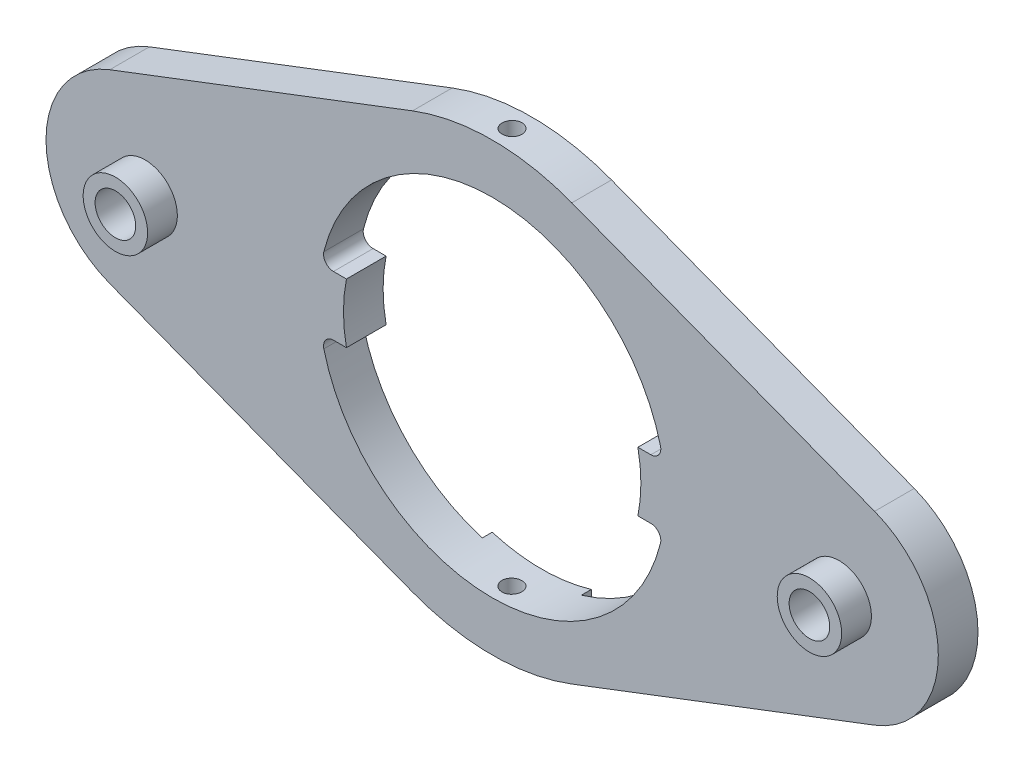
ISO-10303-21;
HEADER;
FILE_DESCRIPTION(('STEP AP214'),'2;1');
FILE_NAME('part.step','',(''),(''),'','','');
FILE_SCHEMA(('AUTOMOTIVE_DESIGN { 1 0 10303 214 1 1 1 1 }'));
ENDSEC;
DATA;
#1=APPLICATION_CONTEXT('core data for automotive mechanical design processes');
#2=APPLICATION_PROTOCOL_DEFINITION('international standard','automotive_design',2000,#1);
#3=PRODUCT_CONTEXT('',#1,'mechanical');
#4=PRODUCT('Part','Part','',(#3));
#5=PRODUCT_RELATED_PRODUCT_CATEGORY('part','',(#4));
#6=PRODUCT_DEFINITION_FORMATION('','',#4);
#7=PRODUCT_DEFINITION_CONTEXT('part definition',#1,'design');
#8=PRODUCT_DEFINITION('design','',#6,#7);
#9=PRODUCT_DEFINITION_SHAPE('','',#8);
#10=(LENGTH_UNIT() NAMED_UNIT(*) SI_UNIT(.MILLI.,.METRE.));
#11=(NAMED_UNIT(*) PLANE_ANGLE_UNIT() SI_UNIT($,.RADIAN.));
#12=(NAMED_UNIT(*) SI_UNIT($,.STERADIAN.) SOLID_ANGLE_UNIT());
#13=UNCERTAINTY_MEASURE_WITH_UNIT(LENGTH_MEASURE(1.E-05),#10,'distance_accuracy_value','');
#14=(GEOMETRIC_REPRESENTATION_CONTEXT(3) GLOBAL_UNCERTAINTY_ASSIGNED_CONTEXT((#13)) GLOBAL_UNIT_ASSIGNED_CONTEXT((#10,
#11,#12)) REPRESENTATION_CONTEXT('',''));
#15=CARTESIAN_POINT('',(0.,0.,0.));
#16=DIRECTION('',(0.,0.,1.));
#17=DIRECTION('',(1.,0.,0.));
#18=AXIS2_PLACEMENT_3D('',#15,#16,#17);
#19=CARTESIAN_POINT('',(0.,0.,-2.));
#20=DIRECTION('',(0.,0.,1.));
#21=DIRECTION('',(1.,0.,0.));
#22=AXIS2_PLACEMENT_3D('',#19,#20,#21);
#23=PLANE('',#22);
#24=CARTESIAN_POINT('',(-35.,0.,-2.));
#25=DIRECTION('',(0.,0.,1.));
#26=DIRECTION('',(1.,0.,0.));
#27=AXIS2_PLACEMENT_3D('',#24,#25,#26);
#28=CIRCLE('',#27,1.65);
#29=CARTESIAN_POINT('',(-33.35,0.,-2.));
#30=VERTEX_POINT('',#29);
#31=EDGE_CURVE('E478',#30,#30,#28,.T.);
#32=ORIENTED_EDGE('',*,*,#31,.T.);
#33=EDGE_LOOP('',(#32));
#34=FACE_BOUND('',#33,.T.);
#35=CARTESIAN_POINT('',(35.,0.,-2.));
#36=DIRECTION('',(0.,0.,1.));
#37=DIRECTION('',(1.,0.,0.));
#38=AXIS2_PLACEMENT_3D('',#35,#36,#37);
#39=CIRCLE('',#38,1.65);
#40=CARTESIAN_POINT('',(36.65,0.,-2.));
#41=VERTEX_POINT('',#40);
#42=EDGE_CURVE('E490',#41,#41,#39,.T.);
#43=ORIENTED_EDGE('',*,*,#42,.T.);
#44=EDGE_LOOP('',(#43));
#45=FACE_BOUND('',#44,.T.);
#46=CARTESIAN_POINT('',(0.,0.,-2.));
#47=DIRECTION('',(0.,0.,1.));
#48=DIRECTION('',(1.,0.,0.));
#49=AXIS2_PLACEMENT_3D('',#46,#47,#48);
#50=CIRCLE('',#49,22.5);
#51=CARTESIAN_POINT('',(8.03571428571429,21.0161199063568,-2.));
#52=VERTEX_POINT('',#51);
#53=CARTESIAN_POINT('',(-8.03571428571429,21.0161199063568,-2.));
#54=VERTEX_POINT('',#53);
#55=EDGE_CURVE('E516',#52,#54,#50,.T.);
#56=ORIENTED_EDGE('',*,*,#55,.F.);
#57=DIRECTION('',(-0.934049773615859,0.357142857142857,0.));
#58=VECTOR('',#57,1.);
#59=CARTESIAN_POINT('',(8.03571428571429,21.0161199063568,-2.));
#60=LINE('',#59,#58);
#61=CARTESIAN_POINT('',(38.5714285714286,9.34049773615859,-2.));
#62=VERTEX_POINT('',#61);
#63=EDGE_CURVE('E398',#62,#52,#60,.T.);
#64=ORIENTED_EDGE('',*,*,#63,.F.);
#65=CARTESIAN_POINT('',(35.,0.,-2.));
#66=DIRECTION('',(0.,0.,1.));
#67=DIRECTION('',(-1.,0.,0.));
#68=AXIS2_PLACEMENT_3D('',#65,#66,#67);
#69=CIRCLE('',#68,10.);
#70=CARTESIAN_POINT('',(38.5714285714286,-9.34049773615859,-2.));
#71=VERTEX_POINT('',#70);
#72=EDGE_CURVE('E388',#71,#62,#69,.T.);
#73=ORIENTED_EDGE('',*,*,#72,.F.);
#74=DIRECTION('',(0.934049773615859,0.357142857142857,0.));
#75=VECTOR('',#74,1.);
#76=CARTESIAN_POINT('',(38.5714285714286,-9.34049773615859,-2.));
#77=LINE('',#76,#75);
#78=CARTESIAN_POINT('',(8.03571428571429,-21.0161199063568,-2.));
#79=VERTEX_POINT('',#78);
#80=EDGE_CURVE('E378',#79,#71,#77,.T.);
#81=ORIENTED_EDGE('',*,*,#80,.F.);
#82=CARTESIAN_POINT('',(0.,0.,-2.));
#83=DIRECTION('',(0.,0.,1.));
#84=DIRECTION('',(1.,0.,0.));
#85=AXIS2_PLACEMENT_3D('',#82,#83,#84);
#86=CIRCLE('',#85,22.5);
#87=CARTESIAN_POINT('',(-8.03571428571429,-21.0161199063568,-2.));
#88=VERTEX_POINT('',#87);
#89=EDGE_CURVE('E389',#88,#79,#86,.T.);
#90=ORIENTED_EDGE('',*,*,#89,.F.);
#91=DIRECTION('',(0.934049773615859,-0.357142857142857,0.));
#92=VECTOR('',#91,1.);
#93=CARTESIAN_POINT('',(-38.5714285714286,-9.34049773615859,-2.));
#94=LINE('',#93,#92);
#95=CARTESIAN_POINT('',(-38.5714285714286,-9.34049773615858,-2.));
#96=VERTEX_POINT('',#95);
#97=EDGE_CURVE('E523',#96,#88,#94,.T.);
#98=ORIENTED_EDGE('',*,*,#97,.F.);
#99=CARTESIAN_POINT('',(-35.,0.,-2.));
#100=DIRECTION('',(0.,0.,1.));
#101=DIRECTION('',(1.,0.,0.));
#102=AXIS2_PLACEMENT_3D('',#99,#100,#101);
#103=CIRCLE('',#102,10.);
#104=CARTESIAN_POINT('',(-38.5714285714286,9.34049773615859,-2.));
#105=VERTEX_POINT('',#104);
#106=EDGE_CURVE('E521',#105,#96,#103,.T.);
#107=ORIENTED_EDGE('',*,*,#106,.F.);
#108=DIRECTION('',(-0.934049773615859,-0.357142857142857,0.));
#109=VECTOR('',#108,1.);
#110=CARTESIAN_POINT('',(-8.03571428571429,21.0161199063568,-2.));
#111=LINE('',#110,#109);
#112=EDGE_CURVE('E519',#54,#105,#111,.T.);
#113=ORIENTED_EDGE('',*,*,#112,.F.);
#114=EDGE_LOOP('',(#56,#64,#73,#81,#90,#98,#107,#113));
#115=FACE_BOUND('',#114,.T.);
#116=DIRECTION('',(0.,-1.,0.));
#117=VECTOR('',#116,1.);
#118=CARTESIAN_POINT('',(4.99999999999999,18.8480768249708,-2.));
#119=LINE('',#118,#117);
#120=CARTESIAN_POINT('',(4.99999999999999,18.8480768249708,-2.));
#121=VERTEX_POINT('',#120);
#122=CARTESIAN_POINT('',(5.,16.7705098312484,-2.));
#123=VERTEX_POINT('',#122);
#124=EDGE_CURVE('E51',#121,#123,#119,.T.);
#125=ORIENTED_EDGE('',*,*,#124,.F.);
#126=CARTESIAN_POINT('',(0.,0.,-2.));
#127=DIRECTION('',(0.,0.,-1.));
#128=DIRECTION('',(-1.,0.,0.));
#129=AXIS2_PLACEMENT_3D('',#126,#127,#128);
#130=CIRCLE('',#129,19.5);
#131=CARTESIAN_POINT('',(-5.00000000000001,18.8480768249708,-2.));
#132=VERTEX_POINT('',#131);
#133=EDGE_CURVE('E56',#132,#121,#130,.T.);
#134=ORIENTED_EDGE('',*,*,#133,.F.);
#135=DIRECTION('',(0.,1.,0.));
#136=VECTOR('',#135,1.);
#137=CARTESIAN_POINT('',(-5.00000000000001,18.8480768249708,-2.));
#138=LINE('',#137,#136);
#139=CARTESIAN_POINT('',(-5.00000000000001,16.7705098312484,-2.));
#140=VERTEX_POINT('',#139);
#141=EDGE_CURVE('E239',#140,#132,#138,.T.);
#142=ORIENTED_EDGE('',*,*,#141,.F.);
#143=CARTESIAN_POINT('',(0.,0.,-2.));
#144=DIRECTION('',(0.,0.,1.));
#145=DIRECTION('',(1.,0.,0.));
#146=AXIS2_PLACEMENT_3D('',#143,#144,#145);
#147=CIRCLE('',#146,17.5);
#148=CARTESIAN_POINT('',(-16.9779809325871,4.24242424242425,-2.));
#149=VERTEX_POINT('',#148);
#150=EDGE_CURVE('E501',#140,#149,#147,.T.);
#151=ORIENTED_EDGE('',*,*,#150,.T.);
#152=CARTESIAN_POINT('',(-16.0078105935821,4.,-2.));
#153=DIRECTION('',(0.,0.,1.));
#154=DIRECTION('',(1.,0.,0.));
#155=AXIS2_PLACEMENT_3D('',#152,#153,#154);
#156=CIRCLE('',#155,1.);
#157=CARTESIAN_POINT('',(-16.0078105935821,3.,-2.));
#158=VERTEX_POINT('',#157);
#159=EDGE_CURVE('E446',#149,#158,#156,.T.);
#160=ORIENTED_EDGE('',*,*,#159,.T.);
#161=DIRECTION('',(-1.,0.,0.));
#162=VECTOR('',#161,1.);
#163=CARTESIAN_POINT('',(-18.,3.,-2.));
#164=LINE('',#163,#162);
#165=CARTESIAN_POINT('',(-14.6969384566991,3.,-2.));
#166=VERTEX_POINT('',#165);
#167=EDGE_CURVE('E603',#166,#158,#164,.T.);
#168=ORIENTED_EDGE('',*,*,#167,.F.);
#169=CARTESIAN_POINT('',(0.,0.,-2.));
#170=DIRECTION('',(0.,0.,-1.));
#171=DIRECTION('',(1.,0.,0.));
#172=AXIS2_PLACEMENT_3D('',#169,#170,#171);
#173=CIRCLE('',#172,15.);
#174=CARTESIAN_POINT('',(-14.6969384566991,-2.99999999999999,-2.));
#175=VERTEX_POINT('',#174);
#176=EDGE_CURVE('E612',#175,#166,#173,.T.);
#177=ORIENTED_EDGE('',*,*,#176,.F.);
#178=DIRECTION('',(1.,0.,0.));
#179=VECTOR('',#178,1.);
#180=CARTESIAN_POINT('',(-18.,-3.,-2.));
#181=LINE('',#180,#179);
#182=CARTESIAN_POINT('',(-16.0078105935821,-3.,-2.));
#183=VERTEX_POINT('',#182);
#184=EDGE_CURVE('E338',#183,#175,#181,.T.);
#185=ORIENTED_EDGE('',*,*,#184,.F.);
#186=CARTESIAN_POINT('',(-16.0078105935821,-4.,-2.));
#187=DIRECTION('',(0.,0.,1.));
#188=DIRECTION('',(1.,0.,0.));
#189=AXIS2_PLACEMENT_3D('',#186,#187,#188);
#190=CIRCLE('',#189,1.);
#191=CARTESIAN_POINT('',(-16.9779809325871,-4.24242424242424,-2.));
#192=VERTEX_POINT('',#191);
#193=EDGE_CURVE('E448',#183,#192,#190,.T.);
#194=ORIENTED_EDGE('',*,*,#193,.T.);
#195=CARTESIAN_POINT('',(-5.00000000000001,-16.7705098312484,-2.));
#196=VERTEX_POINT('',#195);
#197=EDGE_CURVE('E499',#192,#196,#147,.T.);
#198=ORIENTED_EDGE('',*,*,#197,.T.);
#199=DIRECTION('',(0.,1.,0.));
#200=VECTOR('',#199,1.);
#201=CARTESIAN_POINT('',(-5.00000000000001,-16.7705098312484,-2.));
#202=LINE('',#201,#200);
#203=CARTESIAN_POINT('',(-5.00000000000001,-18.8480768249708,-2.));
#204=VERTEX_POINT('',#203);
#205=EDGE_CURVE('E255',#204,#196,#202,.T.);
#206=ORIENTED_EDGE('',*,*,#205,.F.);
#207=CARTESIAN_POINT('',(0.,0.,-2.));
#208=DIRECTION('',(0.,0.,-1.));
#209=DIRECTION('',(-1.,0.,0.));
#210=AXIS2_PLACEMENT_3D('',#207,#208,#209);
#211=CIRCLE('',#210,19.5);
#212=CARTESIAN_POINT('',(4.99999999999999,-18.8480768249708,-2.));
#213=VERTEX_POINT('',#212);
#214=EDGE_CURVE('E245',#213,#204,#211,.T.);
#215=ORIENTED_EDGE('',*,*,#214,.F.);
#216=DIRECTION('',(0.,-1.,0.));
#217=VECTOR('',#216,1.);
#218=CARTESIAN_POINT('',(4.99999999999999,-16.7705098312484,-2.));
#219=LINE('',#218,#217);
#220=CARTESIAN_POINT('',(4.99999999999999,-16.7705098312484,-2.));
#221=VERTEX_POINT('',#220);
#222=EDGE_CURVE('E242',#221,#213,#219,.T.);
#223=ORIENTED_EDGE('',*,*,#222,.F.);
#224=CARTESIAN_POINT('',(16.9779809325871,-4.24242424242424,-2.));
#225=VERTEX_POINT('',#224);
#226=EDGE_CURVE('E493',#221,#225,#147,.T.);
#227=ORIENTED_EDGE('',*,*,#226,.T.);
#228=CARTESIAN_POINT('',(16.0078105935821,-4.,-2.));
#229=DIRECTION('',(0.,0.,1.));
#230=DIRECTION('',(1.,0.,0.));
#231=AXIS2_PLACEMENT_3D('',#228,#229,#230);
#232=CIRCLE('',#231,1.);
#233=CARTESIAN_POINT('',(16.0078105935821,-3.,-2.));
#234=VERTEX_POINT('',#233);
#235=EDGE_CURVE('E457',#225,#234,#232,.T.);
#236=ORIENTED_EDGE('',*,*,#235,.T.);
#237=DIRECTION('',(1.,0.,0.));
#238=VECTOR('',#237,1.);
#239=CARTESIAN_POINT('',(14.6969384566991,-3.,-2.));
#240=LINE('',#239,#238);
#241=CARTESIAN_POINT('',(14.6969384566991,-3.,-2.));
#242=VERTEX_POINT('',#241);
#243=EDGE_CURVE('E588',#242,#234,#240,.T.);
#244=ORIENTED_EDGE('',*,*,#243,.F.);
#245=CARTESIAN_POINT('',(0.,0.,-2.));
#246=DIRECTION('',(0.,0.,-1.));
#247=DIRECTION('',(1.,0.,0.));
#248=AXIS2_PLACEMENT_3D('',#245,#246,#247);
#249=CIRCLE('',#248,15.);
#250=CARTESIAN_POINT('',(14.6969384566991,3.,-2.));
#251=VERTEX_POINT('',#250);
#252=EDGE_CURVE('E594',#251,#242,#249,.T.);
#253=ORIENTED_EDGE('',*,*,#252,.F.);
#254=DIRECTION('',(-1.,0.,0.));
#255=VECTOR('',#254,1.);
#256=CARTESIAN_POINT('',(14.6969384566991,3.,-2.));
#257=LINE('',#256,#255);
#258=CARTESIAN_POINT('',(16.0078105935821,3.,-2.));
#259=VERTEX_POINT('',#258);
#260=EDGE_CURVE('E597',#259,#251,#257,.T.);
#261=ORIENTED_EDGE('',*,*,#260,.F.);
#262=CARTESIAN_POINT('',(16.0078105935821,4.,-2.));
#263=DIRECTION('',(0.,0.,1.));
#264=DIRECTION('',(1.,0.,0.));
#265=AXIS2_PLACEMENT_3D('',#262,#263,#264);
#266=CIRCLE('',#265,1.);
#267=CARTESIAN_POINT('',(16.9779809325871,4.24242424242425,-2.));
#268=VERTEX_POINT('',#267);
#269=EDGE_CURVE('E452',#259,#268,#266,.T.);
#270=ORIENTED_EDGE('',*,*,#269,.T.);
#271=EDGE_CURVE('E498',#268,#123,#147,.T.);
#272=ORIENTED_EDGE('',*,*,#271,.T.);
#273=EDGE_LOOP('',(#125,#134,#142,#151,#160,#168,#177,#185,#194,#198,#206,#215,#223,#227,#236,
#244,#253,#261,#270,#272));
#274=FACE_BOUND('',#273,.T.);
#275=ADVANCED_FACE('F36',(#34,#45,#115,#274),#23,.F.);
#276=CARTESIAN_POINT('',(0.,0.,2.));
#277=DIRECTION('',(0.,0.,1.));
#278=DIRECTION('',(1.,0.,0.));
#279=AXIS2_PLACEMENT_3D('',#276,#277,#278);
#280=PLANE('',#279);
#281=CARTESIAN_POINT('',(35.,0.,2.));
#282=DIRECTION('',(0.,0.,1.));
#283=DIRECTION('',(1.,0.,0.));
#284=AXIS2_PLACEMENT_3D('',#281,#282,#283);
#285=CIRCLE('',#284,1.65);
#286=CARTESIAN_POINT('',(36.65,0.,2.));
#287=VERTEX_POINT('',#286);
#288=EDGE_CURVE('E482',#287,#287,#285,.T.);
#289=ORIENTED_EDGE('',*,*,#288,.F.);
#290=EDGE_LOOP('',(#289));
#291=FACE_BOUND('',#290,.T.);
#292=CARTESIAN_POINT('',(35.,0.,2.));
#293=DIRECTION('',(0.,0.,1.));
#294=DIRECTION('',(1.,0.,0.));
#295=AXIS2_PLACEMENT_3D('',#292,#293,#294);
#296=CIRCLE('',#295,2.04999999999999);
#297=CARTESIAN_POINT('',(37.05,0.,2.));
#298=VERTEX_POINT('',#297);
#299=EDGE_CURVE('E11',#298,#298,#296,.F.);
#300=ORIENTED_EDGE('',*,*,#299,.F.);
#301=EDGE_LOOP('',(#300));
#302=FACE_BOUND('',#301,.T.);
#303=ADVANCED_FACE('F356',(#291,#302),#280,.T.);
#304=CARTESIAN_POINT('',(-35.,0.,2.));
#305=DIRECTION('',(0.,0.,1.));
#306=DIRECTION('',(1.,0.,0.));
#307=AXIS2_PLACEMENT_3D('',#304,#305,#306);
#308=CIRCLE('',#307,1.65);
#309=CARTESIAN_POINT('',(-33.35,0.,2.));
#310=VERTEX_POINT('',#309);
#311=EDGE_CURVE('E476',#310,#310,#308,.T.);
#312=ORIENTED_EDGE('',*,*,#311,.F.);
#313=EDGE_LOOP('',(#312));
#314=FACE_BOUND('',#313,.T.);
#315=CARTESIAN_POINT('',(-35.,0.,2.));
#316=DIRECTION('',(0.,0.,1.));
#317=DIRECTION('',(1.,0.,0.));
#318=AXIS2_PLACEMENT_3D('',#315,#316,#317);
#319=CIRCLE('',#318,2.04999999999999);
#320=CARTESIAN_POINT('',(-32.95,0.,2.));
#321=VERTEX_POINT('',#320);
#322=EDGE_CURVE('E44',#321,#321,#319,.F.);
#323=ORIENTED_EDGE('',*,*,#322,.F.);
#324=EDGE_LOOP('',(#323));
#325=FACE_BOUND('',#324,.T.);
#326=ADVANCED_FACE('F357',(#314,#325),#280,.T.);
#327=CARTESIAN_POINT('',(0.,0.,2.));
#328=DIRECTION('',(0.,0.,-1.));
#329=DIRECTION('',(-1.,0.,0.));
#330=AXIS2_PLACEMENT_3D('',#327,#328,#329);
#331=CYLINDRICAL_SURFACE('',#330,17.5);
#332=CARTESIAN_POINT('',(0.,17.5,1.));
#333=CARTESIAN_POINT('',(-0.0561213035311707,17.4999996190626,0.999997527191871));
#334=CARTESIAN_POINT('',(-0.112282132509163,17.4997271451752,0.995259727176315));
#335=CARTESIAN_POINT('',(-0.223053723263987,17.4986663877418,0.976427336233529));
#336=CARTESIAN_POINT('',(-0.277662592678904,17.4978775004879,0.962321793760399));
#337=CARTESIAN_POINT('',(-0.383709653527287,17.4958731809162,0.92515979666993));
#338=CARTESIAN_POINT('',(-0.435149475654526,17.4946579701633,0.902107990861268));
#339=CARTESIAN_POINT('',(-0.533415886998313,17.4919377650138,0.847715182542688));
#340=CARTESIAN_POINT('',(-0.580243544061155,17.4904328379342,0.816376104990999));
#341=CARTESIAN_POINT('',(-0.668029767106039,17.4873002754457,0.746254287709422));
#342=CARTESIAN_POINT('',(-0.708981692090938,17.4856725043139,0.707463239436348));
#343=CARTESIAN_POINT('',(-0.78379725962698,17.4824788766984,0.623555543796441));
#344=CARTESIAN_POINT('',(-0.817660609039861,17.4809130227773,0.578438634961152));
#345=CARTESIAN_POINT('',(-0.877357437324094,17.4780187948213,0.483123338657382));
#346=CARTESIAN_POINT('',(-0.903185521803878,17.4766905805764,0.432921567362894));
#347=CARTESIAN_POINT('',(-0.946044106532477,17.4744231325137,0.328885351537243));
#348=CARTESIAN_POINT('',(-0.96307468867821,17.4734838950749,0.275050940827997));
#349=CARTESIAN_POINT('',(-0.987836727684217,17.4721015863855,0.165340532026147));
#350=CARTESIAN_POINT('',(-0.995578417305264,17.4716579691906,0.109466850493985));
#351=CARTESIAN_POINT('',(-1.00157449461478,17.4713152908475,-0.00278861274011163));
#352=CARTESIAN_POINT('',(-0.999828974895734,17.4714162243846,-0.0591703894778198));
#353=CARTESIAN_POINT('',(-0.986908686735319,17.4721507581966,-0.170771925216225));
#354=CARTESIAN_POINT('',(-0.97574498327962,17.4727837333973,-0.225992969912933));
#355=CARTESIAN_POINT('',(-0.944322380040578,17.474510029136,-0.333776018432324));
#356=CARTESIAN_POINT('',(-0.924063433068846,17.4756033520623,-0.386338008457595));
#357=CARTESIAN_POINT('',(-0.875012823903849,17.4781278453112,-0.487346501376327));
#358=CARTESIAN_POINT('',(-0.846216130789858,17.4795592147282,-0.535790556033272));
#359=CARTESIAN_POINT('',(-0.780911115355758,17.4825982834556,-0.627161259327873));
#360=CARTESIAN_POINT('',(-0.744402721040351,17.4842059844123,-0.670087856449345));
#361=CARTESIAN_POINT('',(-0.664648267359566,17.4874193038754,-0.749269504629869));
#362=CARTESIAN_POINT('',(-0.621392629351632,17.4890249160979,-0.785514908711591));
#363=CARTESIAN_POINT('',(-0.529405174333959,17.4920508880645,-0.850230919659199));
#364=CARTESIAN_POINT('',(-0.480673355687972,17.4934712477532,-0.878701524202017));
#365=CARTESIAN_POINT('',(-0.379111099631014,17.495966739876,-0.927058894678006));
#366=CARTESIAN_POINT('',(-0.326280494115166,17.4970418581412,-0.946945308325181));
#367=CARTESIAN_POINT('',(-0.21802289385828,17.4987255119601,-0.97756341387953));
#368=CARTESIAN_POINT('',(-0.162595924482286,17.499334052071,-0.988295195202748));
#369=CARTESIAN_POINT('',(-0.0508026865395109,17.5000153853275,-1.00028747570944));
#370=CARTESIAN_POINT('',(0.0055621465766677,17.5000889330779,-1.0015613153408));
#371=CARTESIAN_POINT('',(0.117704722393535,17.4996939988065,-0.994636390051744));
#372=CARTESIAN_POINT('',(0.173482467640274,17.4992255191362,-0.986437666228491));
#373=CARTESIAN_POINT('',(0.282830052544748,17.4977997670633,-0.960811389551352));
#374=CARTESIAN_POINT('',(0.336401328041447,17.4968428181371,-0.943389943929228));
#375=CARTESIAN_POINT('',(0.439859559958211,17.4945478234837,-0.89981895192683));
#376=CARTESIAN_POINT('',(0.489746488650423,17.4932097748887,-0.873669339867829));
#377=CARTESIAN_POINT('',(0.584481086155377,17.4903011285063,-0.813350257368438));
#378=CARTESIAN_POINT('',(0.629323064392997,17.4887302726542,-0.779171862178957));
#379=CARTESIAN_POINT('',(0.712637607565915,17.4855337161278,-0.703778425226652));
#380=CARTESIAN_POINT('',(0.751110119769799,17.4839080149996,-0.662563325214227));
#381=CARTESIAN_POINT('',(0.820638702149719,17.4807828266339,-0.574208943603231));
#382=CARTESIAN_POINT('',(0.8516861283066,17.4792834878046,-0.527062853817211));
#383=CARTESIAN_POINT('',(0.905424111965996,17.4765824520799,-0.428219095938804));
#384=CARTESIAN_POINT('',(0.92811471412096,17.4753807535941,-0.376521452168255));
#385=CARTESIAN_POINT('',(0.964479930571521,17.473411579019,-0.270073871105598));
#386=CARTESIAN_POINT('',(0.978160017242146,17.4726438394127,-0.215325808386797));
#387=CARTESIAN_POINT('',(0.996133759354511,17.4716284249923,-0.104305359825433));
#388=CARTESIAN_POINT('',(1.00042748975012,17.4713807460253,-0.0480329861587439));
#389=CARTESIAN_POINT('',(0.999505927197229,17.4714334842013,0.0643527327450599));
#390=CARTESIAN_POINT('',(0.994304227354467,17.4717331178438,0.120466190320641));
#391=CARTESIAN_POINT('',(0.974567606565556,17.4728450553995,0.231021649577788));
#392=CARTESIAN_POINT('',(0.960032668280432,17.4736573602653,0.285463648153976));
#393=CARTESIAN_POINT('',(0.922045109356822,17.4757029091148,0.391133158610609));
#394=CARTESIAN_POINT('',(0.898592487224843,17.4769361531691,0.442360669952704));
#395=CARTESIAN_POINT('',(0.843437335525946,17.4796845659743,0.540152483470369));
#396=CARTESIAN_POINT('',(0.811735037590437,17.4811997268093,0.586716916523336));
#397=CARTESIAN_POINT('',(0.740930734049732,17.4843437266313,0.673929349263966));
#398=CARTESIAN_POINT('',(0.701819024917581,17.4859727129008,0.714569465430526));
#399=CARTESIAN_POINT('',(0.617316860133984,17.4891596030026,0.788720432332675));
#400=CARTESIAN_POINT('',(0.571924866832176,17.4907174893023,0.822229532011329));
#401=CARTESIAN_POINT('',(0.476106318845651,17.4935880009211,0.881187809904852));
#402=CARTESIAN_POINT('',(0.425674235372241,17.494900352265,0.906628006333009));
#403=CARTESIAN_POINT('',(0.321284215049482,17.4971280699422,0.948649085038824));
#404=CARTESIAN_POINT('',(0.267330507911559,17.4980439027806,0.965240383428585));
#405=CARTESIAN_POINT('',(0.177536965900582,17.4991343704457,0.984762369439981));
#406=CARTESIAN_POINT('',(0.142278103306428,17.4994575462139,0.990469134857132));
#407=CARTESIAN_POINT('',(0.0713514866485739,17.4998904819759,0.998088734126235));
#408=CARTESIAN_POINT('',(0.0356837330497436,17.5000002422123,1.00000157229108));
#409=CARTESIAN_POINT('',(0.,17.5,1.));
#410=B_SPLINE_CURVE_WITH_KNOTS('',3,(#332,#333,#334,#335,#336,#337,#338,#339,#340,#341,#342,
#343,#344,#345,#346,#347,#348,#349,#350,#351,#352,#353,#354,#355,#356,#357,#358,#359,#360,#361,
#362,#363,#364,#365,#366,#367,#368,#369,#370,#371,#372,#373,#374,#375,#376,#377,#378,#379,#380,
#381,#382,#383,#384,#385,#386,#387,#388,#389,#390,#391,#392,#393,#394,#395,#396,#397,#398,#399,
#400,#401,#402,#403,#404,#405,#406,#407,#408,#409),.UNSPECIFIED.,.T.,.F.,(4,2,2,2,2,2,2,2,2,2,2,
2,2,2,2,2,2,2,2,2,2,2,2,2,2,2,2,2,2,2,2,2,2,2,2,2,2,2,4),(0.,0.168233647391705,0.33666431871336,
0.505007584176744,0.673311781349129,0.841804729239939,1.01030464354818,1.17891743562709,
1.34752865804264,1.51595396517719,1.68437762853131,1.85260369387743,2.02083063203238,
2.18915689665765,2.3574847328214,2.52605374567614,2.69462280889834,2.86319878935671,
3.03177312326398,3.20010963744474,3.36844542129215,3.53666987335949,3.70489559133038,
3.87330920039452,4.04172420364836,4.21033432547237,4.37894354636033,4.54745027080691,
4.71595564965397,4.88421999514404,5.05248465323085,5.22074933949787,5.38900930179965,
5.55749116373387,5.72601434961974,5.89472447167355,6.06323556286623,6.17020405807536,
6.27717243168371),.UNSPECIFIED.);
#411=CARTESIAN_POINT('',(0.,17.5,1.));
#412=VERTEX_POINT('',#411);
#413=EDGE_CURVE('E332',#412,#412,#410,.T.);
#414=ORIENTED_EDGE('',*,*,#413,.F.);
#415=EDGE_LOOP('',(#414));
#416=FACE_BOUND('',#415,.T.);
#417=CARTESIAN_POINT('',(0.,0.,2.));
#418=DIRECTION('',(0.,0.,1.));
#419=DIRECTION('',(1.,0.,0.));
#420=AXIS2_PLACEMENT_3D('',#417,#418,#419);
#421=CIRCLE('',#420,17.5);
#422=CARTESIAN_POINT('',(16.9779809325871,4.24242424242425,2.));
#423=VERTEX_POINT('',#422);
#424=CARTESIAN_POINT('',(-16.9779809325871,4.24242424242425,2.));
#425=VERTEX_POINT('',#424);
#426=EDGE_CURVE('E497',#423,#425,#421,.T.);
#427=ORIENTED_EDGE('',*,*,#426,.T.);
#428=DIRECTION('',(0.,0.,-1.));
#429=VECTOR('',#428,1.);
#430=CARTESIAN_POINT('',(-16.9779809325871,4.24242424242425,2.));
#431=LINE('',#430,#429);
#432=EDGE_CURVE('E427',#425,#149,#431,.T.);
#433=ORIENTED_EDGE('',*,*,#432,.T.);
#434=ORIENTED_EDGE('',*,*,#150,.F.);
#435=DIRECTION('',(0.,0.,1.));
#436=VECTOR('',#435,1.);
#437=CARTESIAN_POINT('',(-5.00000000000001,16.7705098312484,-3.));
#438=LINE('',#437,#436);
#439=CARTESIAN_POINT('',(-5.00000000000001,16.7705098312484,-3.));
#440=VERTEX_POINT('',#439);
#441=EDGE_CURVE('E247',#440,#140,#438,.T.);
#442=ORIENTED_EDGE('',*,*,#441,.F.);
#443=CARTESIAN_POINT('',(0.,0.,-3.));
#444=DIRECTION('',(0.,0.,1.));
#445=DIRECTION('',(-1.,0.,0.));
#446=AXIS2_PLACEMENT_3D('',#443,#444,#445);
#447=CIRCLE('',#446,17.5);
#448=CARTESIAN_POINT('',(4.99999999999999,16.7705098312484,-3.));
#449=VERTEX_POINT('',#448);
#450=EDGE_CURVE('E229',#449,#440,#447,.T.);
#451=ORIENTED_EDGE('',*,*,#450,.F.);
#452=DIRECTION('',(0.,0.,1.));
#453=VECTOR('',#452,1.);
#454=CARTESIAN_POINT('',(4.99999999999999,16.7705098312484,-3.));
#455=LINE('',#454,#453);
#456=EDGE_CURVE('E226',#449,#123,#455,.T.);
#457=ORIENTED_EDGE('',*,*,#456,.T.);
#458=ORIENTED_EDGE('',*,*,#271,.F.);
#459=DIRECTION('',(0.,0.,-1.));
#460=VECTOR('',#459,1.);
#461=CARTESIAN_POINT('',(16.9779809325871,4.24242424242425,2.));
#462=LINE('',#461,#460);
#463=EDGE_CURVE('E425',#268,#423,#462,.F.);
#464=ORIENTED_EDGE('',*,*,#463,.T.);
#465=EDGE_LOOP('',(#427,#433,#434,#442,#451,#457,#458,#464));
#466=FACE_BOUND('',#465,.T.);
#467=ADVANCED_FACE('F348',(#416,#466),#331,.F.);
#468=CARTESIAN_POINT('',(35.,0.,2.));
#469=DIRECTION('',(0.,0.,1.));
#470=DIRECTION('',(-1.,0.,0.));
#471=AXIS2_PLACEMENT_3D('',#468,#469,#470);
#472=CIRCLE('',#471,3.25);
#473=CARTESIAN_POINT('',(31.75,0.,2.));
#474=VERTEX_POINT('',#473);
#475=EDGE_CURVE('E280',#474,#474,#472,.T.);
#476=ORIENTED_EDGE('',*,*,#475,.F.);
#477=EDGE_LOOP('',(#476));
#478=FACE_BOUND('',#477,.T.);
#479=CARTESIAN_POINT('',(-35.,0.,2.));
#480=DIRECTION('',(0.,0.,1.));
#481=DIRECTION('',(1.,0.,0.));
#482=AXIS2_PLACEMENT_3D('',#479,#480,#481);
#483=CIRCLE('',#482,3.25);
#484=CARTESIAN_POINT('',(-31.75,0.,2.));
#485=VERTEX_POINT('',#484);
#486=EDGE_CURVE('E289',#485,#485,#483,.T.);
#487=ORIENTED_EDGE('',*,*,#486,.F.);
#488=EDGE_LOOP('',(#487));
#489=FACE_BOUND('',#488,.T.);
#490=DIRECTION('',(-1.,0.,0.));
#491=VECTOR('',#490,1.);
#492=CARTESIAN_POINT('',(-18.,3.,2.));
#493=LINE('',#492,#491);
#494=CARTESIAN_POINT('',(-14.6969384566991,3.,2.));
#495=VERTEX_POINT('',#494);
#496=CARTESIAN_POINT('',(-16.0078105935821,3.,2.));
#497=VERTEX_POINT('',#496);
#498=EDGE_CURVE('E605',#495,#497,#493,.T.);
#499=ORIENTED_EDGE('',*,*,#498,.T.);
#500=CARTESIAN_POINT('',(-16.0078105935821,4.,2.));
#501=DIRECTION('',(0.,0.,1.));
#502=DIRECTION('',(1.,0.,0.));
#503=AXIS2_PLACEMENT_3D('',#500,#501,#502);
#504=CIRCLE('',#503,1.);
#505=EDGE_CURVE('E444',#497,#425,#504,.F.);
#506=ORIENTED_EDGE('',*,*,#505,.T.);
#507=ORIENTED_EDGE('',*,*,#426,.F.);
#508=CARTESIAN_POINT('',(16.0078105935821,4.,2.));
#509=DIRECTION('',(0.,0.,1.));
#510=DIRECTION('',(1.,0.,0.));
#511=AXIS2_PLACEMENT_3D('',#508,#509,#510);
#512=CIRCLE('',#511,1.);
#513=CARTESIAN_POINT('',(16.0078105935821,3.,2.));
#514=VERTEX_POINT('',#513);
#515=EDGE_CURVE('E454',#423,#514,#512,.F.);
#516=ORIENTED_EDGE('',*,*,#515,.T.);
#517=DIRECTION('',(-1.,0.,0.));
#518=VECTOR('',#517,1.);
#519=CARTESIAN_POINT('',(14.6969384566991,3.,2.));
#520=LINE('',#519,#518);
#521=CARTESIAN_POINT('',(14.6969384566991,3.,2.));
#522=VERTEX_POINT('',#521);
#523=EDGE_CURVE('E577',#514,#522,#520,.T.);
#524=ORIENTED_EDGE('',*,*,#523,.T.);
#525=CARTESIAN_POINT('',(0.,0.,2.));
#526=DIRECTION('',(0.,0.,-1.));
#527=DIRECTION('',(1.,0.,0.));
#528=AXIS2_PLACEMENT_3D('',#525,#526,#527);
#529=CIRCLE('',#528,15.);
#530=CARTESIAN_POINT('',(14.6969384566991,-3.,2.));
#531=VERTEX_POINT('',#530);
#532=EDGE_CURVE('E585',#522,#531,#529,.T.);
#533=ORIENTED_EDGE('',*,*,#532,.T.);
#534=DIRECTION('',(1.,0.,0.));
#535=VECTOR('',#534,1.);
#536=CARTESIAN_POINT('',(14.6969384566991,-3.,2.));
#537=LINE('',#536,#535);
#538=CARTESIAN_POINT('',(16.0078105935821,-3.,2.));
#539=VERTEX_POINT('',#538);
#540=EDGE_CURVE('E586',#531,#539,#537,.T.);
#541=ORIENTED_EDGE('',*,*,#540,.T.);
#542=CARTESIAN_POINT('',(16.0078105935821,-4.,2.));
#543=DIRECTION('',(0.,0.,1.));
#544=DIRECTION('',(1.,0.,0.));
#545=AXIS2_PLACEMENT_3D('',#542,#543,#544);
#546=CIRCLE('',#545,1.);
#547=CARTESIAN_POINT('',(16.9779809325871,-4.24242424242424,2.));
#548=VERTEX_POINT('',#547);
#549=EDGE_CURVE('E456',#539,#548,#546,.F.);
#550=ORIENTED_EDGE('',*,*,#549,.T.);
#551=CARTESIAN_POINT('',(-16.9779809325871,-4.24242424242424,2.));
#552=VERTEX_POINT('',#551);
#553=EDGE_CURVE('E494',#552,#548,#421,.T.);
#554=ORIENTED_EDGE('',*,*,#553,.F.);
#555=CARTESIAN_POINT('',(-16.0078105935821,-4.,2.));
#556=DIRECTION('',(0.,0.,1.));
#557=DIRECTION('',(1.,0.,0.));
#558=AXIS2_PLACEMENT_3D('',#555,#556,#557);
#559=CIRCLE('',#558,1.);
#560=CARTESIAN_POINT('',(-16.0078105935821,-3.,2.));
#561=VERTEX_POINT('',#560);
#562=EDGE_CURVE('E450',#552,#561,#559,.F.);
#563=ORIENTED_EDGE('',*,*,#562,.T.);
#564=DIRECTION('',(1.,0.,0.));
#565=VECTOR('',#564,1.);
#566=CARTESIAN_POINT('',(-18.,-3.,2.));
#567=LINE('',#566,#565);
#568=CARTESIAN_POINT('',(-14.6969384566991,-2.99999999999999,2.));
#569=VERTEX_POINT('',#568);
#570=EDGE_CURVE('E337',#561,#569,#567,.T.);
#571=ORIENTED_EDGE('',*,*,#570,.T.);
#572=CARTESIAN_POINT('',(0.,0.,2.));
#573=DIRECTION('',(0.,0.,-1.));
#574=DIRECTION('',(1.,0.,0.));
#575=AXIS2_PLACEMENT_3D('',#572,#573,#574);
#576=CIRCLE('',#575,15.);
#577=EDGE_CURVE('E607',#569,#495,#576,.T.);
#578=ORIENTED_EDGE('',*,*,#577,.T.);
#579=EDGE_LOOP('',(#499,#506,#507,#516,#524,#533,#541,#550,#554,#563,#571,#578));
#580=FACE_BOUND('',#579,.T.);
#581=CARTESIAN_POINT('',(0.,0.,2.));
#582=DIRECTION('',(0.,0.,1.));
#583=DIRECTION('',(1.,0.,0.));
#584=AXIS2_PLACEMENT_3D('',#581,#582,#583);
#585=CIRCLE('',#584,22.5);
#586=CARTESIAN_POINT('',(8.03571428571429,21.0161199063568,2.));
#587=VERTEX_POINT('',#586);
#588=CARTESIAN_POINT('',(-8.03571428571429,21.0161199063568,2.));
#589=VERTEX_POINT('',#588);
#590=EDGE_CURVE('E400',#587,#589,#585,.T.);
#591=ORIENTED_EDGE('',*,*,#590,.T.);
#592=DIRECTION('',(-0.934049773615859,-0.357142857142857,0.));
#593=VECTOR('',#592,1.);
#594=CARTESIAN_POINT('',(-8.03571428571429,21.0161199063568,2.));
#595=LINE('',#594,#593);
#596=CARTESIAN_POINT('',(-38.5714285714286,9.34049773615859,2.));
#597=VERTEX_POINT('',#596);
#598=EDGE_CURVE('E504',#589,#597,#595,.T.);
#599=ORIENTED_EDGE('',*,*,#598,.T.);
#600=CARTESIAN_POINT('',(-35.,0.,2.));
#601=DIRECTION('',(0.,0.,1.));
#602=DIRECTION('',(1.,0.,0.));
#603=AXIS2_PLACEMENT_3D('',#600,#601,#602);
#604=CIRCLE('',#603,10.);
#605=CARTESIAN_POINT('',(-38.5714285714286,-9.34049773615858,2.));
#606=VERTEX_POINT('',#605);
#607=EDGE_CURVE('E506',#597,#606,#604,.T.);
#608=ORIENTED_EDGE('',*,*,#607,.T.);
#609=DIRECTION('',(0.934049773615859,-0.357142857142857,0.));
#610=VECTOR('',#609,1.);
#611=CARTESIAN_POINT('',(-38.5714285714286,-9.34049773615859,2.));
#612=LINE('',#611,#610);
#613=CARTESIAN_POINT('',(-8.03571428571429,-21.0161199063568,2.));
#614=VERTEX_POINT('',#613);
#615=EDGE_CURVE('E508',#606,#614,#612,.T.);
#616=ORIENTED_EDGE('',*,*,#615,.T.);
#617=CARTESIAN_POINT('',(0.,0.,2.));
#618=DIRECTION('',(0.,0.,1.));
#619=DIRECTION('',(1.,0.,0.));
#620=AXIS2_PLACEMENT_3D('',#617,#618,#619);
#621=CIRCLE('',#620,22.5);
#622=CARTESIAN_POINT('',(8.03571428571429,-21.0161199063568,2.));
#623=VERTEX_POINT('',#622);
#624=EDGE_CURVE('E510',#614,#623,#621,.T.);
#625=ORIENTED_EDGE('',*,*,#624,.T.);
#626=DIRECTION('',(0.934049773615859,0.357142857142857,0.));
#627=VECTOR('',#626,1.);
#628=CARTESIAN_POINT('',(38.5714285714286,-9.34049773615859,2.));
#629=LINE('',#628,#627);
#630=CARTESIAN_POINT('',(38.5714285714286,-9.34049773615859,2.));
#631=VERTEX_POINT('',#630);
#632=EDGE_CURVE('E512',#623,#631,#629,.T.);
#633=ORIENTED_EDGE('',*,*,#632,.T.);
#634=CARTESIAN_POINT('',(35.,0.,2.));
#635=DIRECTION('',(0.,0.,1.));
#636=DIRECTION('',(-1.,0.,0.));
#637=AXIS2_PLACEMENT_3D('',#634,#635,#636);
#638=CIRCLE('',#637,10.);
#639=CARTESIAN_POINT('',(38.5714285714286,9.34049773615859,2.));
#640=VERTEX_POINT('',#639);
#641=EDGE_CURVE('E393',#631,#640,#638,.T.);
#642=ORIENTED_EDGE('',*,*,#641,.T.);
#643=DIRECTION('',(-0.934049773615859,0.357142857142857,0.));
#644=VECTOR('',#643,1.);
#645=CARTESIAN_POINT('',(8.03571428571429,21.0161199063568,2.));
#646=LINE('',#645,#644);
#647=EDGE_CURVE('E407',#640,#587,#646,.T.);
#648=ORIENTED_EDGE('',*,*,#647,.T.);
#649=EDGE_LOOP('',(#591,#599,#608,#616,#625,#633,#642,#648));
#650=FACE_BOUND('',#649,.T.);
#651=ADVANCED_FACE('F350',(#478,#489,#580,#650),#280,.T.);
#652=CARTESIAN_POINT('',(0.,0.,2.));
#653=DIRECTION('',(0.,0.,-1.));
#654=DIRECTION('',(-1.,0.,0.));
#655=AXIS2_PLACEMENT_3D('',#652,#653,#654);
#656=CYLINDRICAL_SURFACE('',#655,22.5);
#657=CARTESIAN_POINT('',(0.,22.5,1.));
#658=CARTESIAN_POINT('',(-0.0561407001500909,22.4999997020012,0.999997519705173));
#659=CARTESIAN_POINT('',(-0.112321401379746,22.4997876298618,0.995256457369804));
#660=CARTESIAN_POINT('',(-0.223133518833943,22.4989620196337,0.976410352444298));
#661=CARTESIAN_POINT('',(-0.277763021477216,22.4983480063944,0.962294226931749));
#662=CARTESIAN_POINT('',(-0.383851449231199,22.496788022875,0.925102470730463));
#663=CARTESIAN_POINT('',(-0.435311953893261,22.4958422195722,0.902031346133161));
#664=CARTESIAN_POINT('',(-0.533615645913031,22.493725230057,0.847591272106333));
#665=CARTESIAN_POINT('',(-0.580459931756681,22.4925540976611,0.816224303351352));
#666=CARTESIAN_POINT('',(-0.668254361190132,22.4901171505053,0.746053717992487));
#667=CARTESIAN_POINT('',(-0.709200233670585,22.4888512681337,0.707244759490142));
#668=CARTESIAN_POINT('',(-0.783999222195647,22.4863680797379,0.623302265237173));
#669=CARTESIAN_POINT('',(-0.817852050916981,22.4851507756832,0.578168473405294));
#670=CARTESIAN_POINT('',(-0.877514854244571,22.4829015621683,0.482836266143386));
#671=CARTESIAN_POINT('',(-0.903321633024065,22.4818697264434,0.43263584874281));
#672=CARTESIAN_POINT('',(-0.946139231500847,22.4801085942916,0.328609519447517));
#673=CARTESIAN_POINT('',(-0.963150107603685,22.4793792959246,0.274783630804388));
#674=CARTESIAN_POINT('',(-0.987882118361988,22.4783060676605,0.165072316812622));
#675=CARTESIAN_POINT('',(-0.99560944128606,22.4779618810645,0.109188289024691));
#676=CARTESIAN_POINT('',(-1.00157408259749,22.4776969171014,-0.00308469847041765));
#677=CARTESIAN_POINT('',(-0.999811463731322,22.4777761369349,-0.0594736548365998));
#678=CARTESIAN_POINT('',(-0.986851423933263,22.4783488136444,-0.171113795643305));
#679=CARTESIAN_POINT('',(-0.97566068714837,22.4788419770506,-0.226365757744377));
#680=CARTESIAN_POINT('',(-0.944172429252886,22.4801864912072,-0.334206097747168));
#681=CARTESIAN_POINT('',(-0.923874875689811,22.481037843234,-0.386794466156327));
#682=CARTESIAN_POINT('',(-0.874741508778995,22.4830031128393,-0.487836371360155));
#683=CARTESIAN_POINT('',(-0.845902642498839,22.4841171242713,-0.53628842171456));
#684=CARTESIAN_POINT('',(-0.780507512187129,22.4864820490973,-0.627666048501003));
#685=CARTESIAN_POINT('',(-0.743951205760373,22.4877329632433,-0.670591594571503));
#686=CARTESIAN_POINT('',(-0.664121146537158,22.4902320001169,-0.749736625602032));
#687=CARTESIAN_POINT('',(-0.620841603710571,22.4914801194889,-0.785950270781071));
#688=CARTESIAN_POINT('',(-0.528813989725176,22.493831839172,-0.850598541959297));
#689=CARTESIAN_POINT('',(-0.480065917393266,22.494935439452,-0.879033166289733));
#690=CARTESIAN_POINT('',(-0.378481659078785,22.4968737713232,-0.927315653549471));
#691=CARTESIAN_POINT('',(-0.325645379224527,22.4977084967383,-0.947163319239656));
#692=CARTESIAN_POINT('',(-0.217386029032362,22.4990149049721,-0.977704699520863));
#693=CARTESIAN_POINT('',(-0.161962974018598,22.4994865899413,-0.988398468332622));
#694=CARTESIAN_POINT('',(-0.0501540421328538,22.5000134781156,-1.0003213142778));
#695=CARTESIAN_POINT('',(0.00623097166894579,22.5000690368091,-1.00155847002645));
#696=CARTESIAN_POINT('',(0.118407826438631,22.4997583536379,-0.994554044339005));
#697=CARTESIAN_POINT('',(0.174199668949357,22.4993921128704,-0.986312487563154));
#698=CARTESIAN_POINT('',(0.283583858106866,22.4982793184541,-0.96059127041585));
#699=CARTESIAN_POINT('',(0.337177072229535,22.4975329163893,-0.943115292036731));
#700=CARTESIAN_POINT('',(0.440669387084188,22.4957438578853,-0.89942504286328));
#701=CARTESIAN_POINT('',(0.49056847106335,22.4947012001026,-0.873210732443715));
#702=CARTESIAN_POINT('',(0.585293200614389,22.492436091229,-0.812767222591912));
#703=CARTESIAN_POINT('',(0.630115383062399,22.4912135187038,-0.778532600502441));
#704=CARTESIAN_POINT('',(0.713379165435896,22.4887267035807,-0.703028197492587));
#705=CARTESIAN_POINT('',(0.751820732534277,22.4874624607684,-0.661758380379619));
#706=CARTESIAN_POINT('',(0.821259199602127,22.4850337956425,-0.573320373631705));
#707=CARTESIAN_POINT('',(0.852250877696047,22.4838694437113,-0.526148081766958));
#708=CARTESIAN_POINT('',(0.90587414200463,22.4817729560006,-0.42726495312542));
#709=CARTESIAN_POINT('',(0.928505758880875,22.4808408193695,-0.375554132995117));
#710=CARTESIAN_POINT('',(0.964757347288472,22.4793143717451,-0.269081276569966));
#711=CARTESIAN_POINT('',(0.978380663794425,22.478719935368,-0.21432038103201));
#712=CARTESIAN_POINT('',(0.996239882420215,22.477935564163,-0.103285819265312));
#713=CARTESIAN_POINT('',(1.00047582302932,22.4777456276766,-0.0470121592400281));
#714=CARTESIAN_POINT('',(0.999439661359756,22.4777917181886,0.065398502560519));
#715=CARTESIAN_POINT('',(0.994175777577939,22.4780273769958,0.121535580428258));
#716=CARTESIAN_POINT('',(0.974306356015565,22.4788973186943,0.232128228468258));
#717=CARTESIAN_POINT('',(0.959700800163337,22.4795316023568,0.286583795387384));
#718=CARTESIAN_POINT('',(0.921564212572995,22.4811272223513,0.392269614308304));
#719=CARTESIAN_POINT('',(0.898033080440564,22.4820885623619,0.443499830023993));
#720=CARTESIAN_POINT('',(0.842714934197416,22.4842299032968,0.541282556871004));
#721=CARTESIAN_POINT('',(0.810928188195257,22.4854098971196,0.587835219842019));
#722=CARTESIAN_POINT('',(0.739972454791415,22.4878566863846,0.674981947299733));
#723=CARTESIAN_POINT('',(0.700797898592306,22.4891235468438,0.715571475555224));
#724=CARTESIAN_POINT('',(0.616179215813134,22.4916008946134,0.789610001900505));
#725=CARTESIAN_POINT('',(0.570733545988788,22.4928113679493,0.823057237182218));
#726=CARTESIAN_POINT('',(0.474832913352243,22.4950402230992,0.881874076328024));
#727=CARTESIAN_POINT('',(0.424373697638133,22.4960584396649,0.907236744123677));
#728=CARTESIAN_POINT('',(0.319946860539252,22.4977854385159,0.949100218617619));
#729=CARTESIAN_POINT('',(0.26598348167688,22.498494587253,0.965611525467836));
#730=CARTESIAN_POINT('',(0.176402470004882,22.4993353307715,0.984957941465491));
#731=CARTESIAN_POINT('',(0.141365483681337,22.4995834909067,0.990591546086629));
#732=CARTESIAN_POINT('',(0.0708909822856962,22.4999159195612,0.998113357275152));
#733=CARTESIAN_POINT('',(0.0354534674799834,22.5000001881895,1.00000156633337));
#734=CARTESIAN_POINT('',(0.,22.5,1.));
#735=B_SPLINE_CURVE_WITH_KNOTS('',3,(#657,#658,#659,#660,#661,#662,#663,#664,#665,#666,#667,
#668,#669,#670,#671,#672,#673,#674,#675,#676,#677,#678,#679,#680,#681,#682,#683,#684,#685,#686,
#687,#688,#689,#690,#691,#692,#693,#694,#695,#696,#697,#698,#699,#700,#701,#702,#703,#704,#705,
#706,#707,#708,#709,#710,#711,#712,#713,#714,#715,#716,#717,#718,#719,#720,#721,#722,#723,#724,
#725,#726,#727,#728,#729,#730,#731,#732,#733,#734),.UNSPECIFIED.,.T.,.F.,(4,2,2,2,2,2,2,2,2,2,2,
2,2,2,2,2,2,2,2,2,2,2,2,2,2,2,2,2,2,2,2,2,2,2,2,2,2,2,4),(0.,0.168292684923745,0.33678467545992,
0.505191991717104,0.673559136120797,0.84204759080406,1.0105428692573,1.17910498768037,
1.34766602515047,1.51611464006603,1.68456214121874,1.85289032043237,2.02121909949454,
2.18960811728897,2.3579980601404,2.52653383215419,2.69506964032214,2.86360931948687,
3.03214800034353,3.20054268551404,3.36893693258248,3.53726408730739,3.70559200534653,
3.87403406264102,4.04247698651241,4.21103763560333,4.37959766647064,4.54809507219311,
4.71659178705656,4.88494280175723,5.05329414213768,5.22164737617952,5.38999514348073,
5.55847031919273,5.72698702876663,5.89564792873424,6.0641083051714,6.17038705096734,
6.27666572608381),.UNSPECIFIED.);
#736=CARTESIAN_POINT('',(0.,22.5,1.));
#737=VERTEX_POINT('',#736);
#738=EDGE_CURVE('E303',#737,#737,#735,.T.);
#739=ORIENTED_EDGE('',*,*,#738,.T.);
#740=EDGE_LOOP('',(#739));
#741=FACE_BOUND('',#740,.T.);
#742=ORIENTED_EDGE('',*,*,#55,.T.);
#743=DIRECTION('',(0.,0.,-1.));
#744=VECTOR('',#743,1.);
#745=CARTESIAN_POINT('',(-8.03571428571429,21.0161199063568,2.));
#746=LINE('',#745,#744);
#747=EDGE_CURVE('E419',#589,#54,#746,.T.);
#748=ORIENTED_EDGE('',*,*,#747,.F.);
#749=ORIENTED_EDGE('',*,*,#590,.F.);
#750=DIRECTION('',(0.,0.,-1.));
#751=VECTOR('',#750,1.);
#752=CARTESIAN_POINT('',(8.03571428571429,21.0161199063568,2.));
#753=LINE('',#752,#751);
#754=EDGE_CURVE('E404',#587,#52,#753,.T.);
#755=ORIENTED_EDGE('',*,*,#754,.T.);
#756=EDGE_LOOP('',(#742,#748,#749,#755));
#757=FACE_BOUND('',#756,.T.);
#758=ADVANCED_FACE('F354',(#741,#757),#656,.T.);
#759=CARTESIAN_POINT('',(-8.03571428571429,21.0161199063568,2.));
#760=DIRECTION('',(0.357142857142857,-0.934049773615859,0.));
#761=DIRECTION('',(0.934049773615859,0.357142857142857,0.));
#762=AXIS2_PLACEMENT_3D('',#759,#760,#761);
#763=PLANE('',#762);
#764=ORIENTED_EDGE('',*,*,#112,.T.);
#765=DIRECTION('',(0.,0.,-1.));
#766=VECTOR('',#765,1.);
#767=CARTESIAN_POINT('',(-38.5714285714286,9.34049773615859,2.));
#768=LINE('',#767,#766);
#769=EDGE_CURVE('E416',#597,#105,#768,.T.);
#770=ORIENTED_EDGE('',*,*,#769,.F.);
#771=ORIENTED_EDGE('',*,*,#598,.F.);
#772=ORIENTED_EDGE('',*,*,#747,.T.);
#773=EDGE_LOOP('',(#764,#770,#771,#772));
#774=FACE_BOUND('',#773,.T.);
#775=ADVANCED_FACE('F537',(#774),#763,.F.);
#776=CARTESIAN_POINT('',(-35.,0.,2.));
#777=DIRECTION('',(0.,0.,-1.));
#778=DIRECTION('',(-1.,0.,0.));
#779=AXIS2_PLACEMENT_3D('',#776,#777,#778);
#780=CYLINDRICAL_SURFACE('',#779,10.);
#781=ORIENTED_EDGE('',*,*,#106,.T.);
#782=DIRECTION('',(0.,0.,-1.));
#783=VECTOR('',#782,1.);
#784=CARTESIAN_POINT('',(-38.5714285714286,-9.34049773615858,2.));
#785=LINE('',#784,#783);
#786=EDGE_CURVE('E413',#606,#96,#785,.T.);
#787=ORIENTED_EDGE('',*,*,#786,.F.);
#788=ORIENTED_EDGE('',*,*,#607,.F.);
#789=ORIENTED_EDGE('',*,*,#769,.T.);
#790=EDGE_LOOP('',(#781,#787,#788,#789));
#791=FACE_BOUND('',#790,.T.);
#792=ADVANCED_FACE('F534',(#791),#780,.T.);
#793=CARTESIAN_POINT('',(-38.5714285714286,-9.34049773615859,2.));
#794=DIRECTION('',(0.357142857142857,0.934049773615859,0.));
#795=DIRECTION('',(-0.934049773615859,0.357142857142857,0.));
#796=AXIS2_PLACEMENT_3D('',#793,#794,#795);
#797=PLANE('',#796);
#798=ORIENTED_EDGE('',*,*,#97,.T.);
#799=DIRECTION('',(0.,0.,-1.));
#800=VECTOR('',#799,1.);
#801=CARTESIAN_POINT('',(-8.03571428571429,-21.0161199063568,2.));
#802=LINE('',#801,#800);
#803=EDGE_CURVE('E410',#614,#88,#802,.T.);
#804=ORIENTED_EDGE('',*,*,#803,.F.);
#805=ORIENTED_EDGE('',*,*,#615,.F.);
#806=ORIENTED_EDGE('',*,*,#786,.T.);
#807=EDGE_LOOP('',(#798,#804,#805,#806));
#808=FACE_BOUND('',#807,.T.);
#809=ADVANCED_FACE('F373',(#808),#797,.F.);
#810=CARTESIAN_POINT('',(0.,0.,2.));
#811=DIRECTION('',(0.,0.,-1.));
#812=DIRECTION('',(-1.,0.,0.));
#813=AXIS2_PLACEMENT_3D('',#810,#811,#812);
#814=CYLINDRICAL_SURFACE('',#813,22.5);
#815=CARTESIAN_POINT('',(0.,-22.5,1.));
#816=CARTESIAN_POINT('',(0.0561407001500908,-22.4999997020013,0.999997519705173));
#817=CARTESIAN_POINT('',(0.112321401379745,-22.4997876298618,0.995256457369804));
#818=CARTESIAN_POINT('',(0.223133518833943,-22.4989620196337,0.976410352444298));
#819=CARTESIAN_POINT('',(0.277763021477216,-22.4983480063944,0.962294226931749));
#820=CARTESIAN_POINT('',(0.383851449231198,-22.496788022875,0.925102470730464));
#821=CARTESIAN_POINT('',(0.435311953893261,-22.4958422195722,0.902031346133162));
#822=CARTESIAN_POINT('',(0.533615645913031,-22.493725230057,0.847591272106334));
#823=CARTESIAN_POINT('',(0.580459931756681,-22.4925540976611,0.816224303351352));
#824=CARTESIAN_POINT('',(0.668254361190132,-22.4901171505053,0.746053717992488));
#825=CARTESIAN_POINT('',(0.709200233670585,-22.4888512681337,0.707244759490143));
#826=CARTESIAN_POINT('',(0.783999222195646,-22.4863680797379,0.623302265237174));
#827=CARTESIAN_POINT('',(0.817852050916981,-22.4851507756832,0.578168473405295));
#828=CARTESIAN_POINT('',(0.87751485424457,-22.4829015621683,0.482836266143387));
#829=CARTESIAN_POINT('',(0.903321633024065,-22.4818697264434,0.432635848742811));
#830=CARTESIAN_POINT('',(0.946139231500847,-22.4801085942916,0.328609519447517));
#831=CARTESIAN_POINT('',(0.963150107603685,-22.4793792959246,0.274783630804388));
#832=CARTESIAN_POINT('',(0.987882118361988,-22.4783060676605,0.165072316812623));
#833=CARTESIAN_POINT('',(0.99560944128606,-22.4779618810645,0.109188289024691));
#834=CARTESIAN_POINT('',(1.00157408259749,-22.4776969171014,-0.00308469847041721));
#835=CARTESIAN_POINT('',(0.999811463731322,-22.4777761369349,-0.0594736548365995));
#836=CARTESIAN_POINT('',(0.986851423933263,-22.4783488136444,-0.171113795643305));
#837=CARTESIAN_POINT('',(0.97566068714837,-22.4788419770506,-0.226365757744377));
#838=CARTESIAN_POINT('',(0.944172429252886,-22.4801864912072,-0.334206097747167));
#839=CARTESIAN_POINT('',(0.923874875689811,-22.481037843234,-0.386794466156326));
#840=CARTESIAN_POINT('',(0.874741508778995,-22.4830031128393,-0.487836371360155));
#841=CARTESIAN_POINT('',(0.845902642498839,-22.4841171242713,-0.53628842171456));
#842=CARTESIAN_POINT('',(0.780507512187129,-22.4864820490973,-0.627666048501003));
#843=CARTESIAN_POINT('',(0.743951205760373,-22.4877329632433,-0.670591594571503));
#844=CARTESIAN_POINT('',(0.664121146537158,-22.4902320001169,-0.749736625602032));
#845=CARTESIAN_POINT('',(0.62084160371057,-22.4914801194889,-0.785950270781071));
#846=CARTESIAN_POINT('',(0.528813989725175,-22.493831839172,-0.850598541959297));
#847=CARTESIAN_POINT('',(0.480065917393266,-22.494935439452,-0.879033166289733));
#848=CARTESIAN_POINT('',(0.378481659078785,-22.4968737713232,-0.927315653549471));
#849=CARTESIAN_POINT('',(0.325645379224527,-22.4977084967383,-0.947163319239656));
#850=CARTESIAN_POINT('',(0.217386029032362,-22.4990149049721,-0.977704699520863));
#851=CARTESIAN_POINT('',(0.161962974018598,-22.4994865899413,-0.988398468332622));
#852=CARTESIAN_POINT('',(0.0501540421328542,-22.5000134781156,-1.0003213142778));
#853=CARTESIAN_POINT('',(-0.00623097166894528,-22.5000690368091,-1.00155847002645));
#854=CARTESIAN_POINT('',(-0.118407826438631,-22.4997583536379,-0.994554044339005));
#855=CARTESIAN_POINT('',(-0.174199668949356,-22.4993921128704,-0.986312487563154));
#856=CARTESIAN_POINT('',(-0.283583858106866,-22.4982793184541,-0.96059127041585));
#857=CARTESIAN_POINT('',(-0.337177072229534,-22.4975329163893,-0.943115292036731));
#858=CARTESIAN_POINT('',(-0.440669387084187,-22.4957438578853,-0.89942504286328));
#859=CARTESIAN_POINT('',(-0.490568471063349,-22.4947012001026,-0.873210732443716));
#860=CARTESIAN_POINT('',(-0.585293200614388,-22.492436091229,-0.812767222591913));
#861=CARTESIAN_POINT('',(-0.630115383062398,-22.4912135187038,-0.778532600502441));
#862=CARTESIAN_POINT('',(-0.713379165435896,-22.4887267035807,-0.703028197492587));
#863=CARTESIAN_POINT('',(-0.751820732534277,-22.4874624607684,-0.661758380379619));
#864=CARTESIAN_POINT('',(-0.821259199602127,-22.4850337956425,-0.573320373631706));
#865=CARTESIAN_POINT('',(-0.852250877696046,-22.4838694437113,-0.526148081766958));
#866=CARTESIAN_POINT('',(-0.90587414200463,-22.4817729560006,-0.427264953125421));
#867=CARTESIAN_POINT('',(-0.928505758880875,-22.4808408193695,-0.375554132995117));
#868=CARTESIAN_POINT('',(-0.964757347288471,-22.4793143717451,-0.269081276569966));
#869=CARTESIAN_POINT('',(-0.978380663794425,-22.478719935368,-0.21432038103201));
#870=CARTESIAN_POINT('',(-0.996239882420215,-22.477935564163,-0.103285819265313));
#871=CARTESIAN_POINT('',(-1.00047582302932,-22.4777456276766,-0.0470121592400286));
#872=CARTESIAN_POINT('',(-0.999439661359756,-22.4777917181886,0.0653985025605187));
#873=CARTESIAN_POINT('',(-0.994175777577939,-22.4780273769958,0.121535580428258));
#874=CARTESIAN_POINT('',(-0.974306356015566,-22.4788973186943,0.232128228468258));
#875=CARTESIAN_POINT('',(-0.959700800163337,-22.4795316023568,0.286583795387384));
#876=CARTESIAN_POINT('',(-0.921564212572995,-22.4811272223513,0.392269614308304));
#877=CARTESIAN_POINT('',(-0.898033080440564,-22.4820885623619,0.443499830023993));
#878=CARTESIAN_POINT('',(-0.842714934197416,-22.4842299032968,0.541282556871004));
#879=CARTESIAN_POINT('',(-0.810928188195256,-22.4854098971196,0.58783521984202));
#880=CARTESIAN_POINT('',(-0.739972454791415,-22.4878566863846,0.674981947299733));
#881=CARTESIAN_POINT('',(-0.700797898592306,-22.4891235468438,0.715571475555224));
#882=CARTESIAN_POINT('',(-0.616179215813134,-22.4916008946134,0.789610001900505));
#883=CARTESIAN_POINT('',(-0.570733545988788,-22.4928113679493,0.823057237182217));
#884=CARTESIAN_POINT('',(-0.474832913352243,-22.4950402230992,0.881874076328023));
#885=CARTESIAN_POINT('',(-0.424373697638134,-22.4960584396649,0.907236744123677));
#886=CARTESIAN_POINT('',(-0.319946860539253,-22.4977854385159,0.949100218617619));
#887=CARTESIAN_POINT('',(-0.265983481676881,-22.498494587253,0.965611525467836));
#888=CARTESIAN_POINT('',(-0.176402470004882,-22.4993353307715,0.984957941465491));
#889=CARTESIAN_POINT('',(-0.141365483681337,-22.4995834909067,0.990591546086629));
#890=CARTESIAN_POINT('',(-0.0708909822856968,-22.4999159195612,0.998113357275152));
#891=CARTESIAN_POINT('',(-0.0354534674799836,-22.5000001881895,1.00000156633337));
#892=CARTESIAN_POINT('',(0.,-22.5,1.));
#893=B_SPLINE_CURVE_WITH_KNOTS('',3,(#815,#816,#817,#818,#819,#820,#821,#822,#823,#824,#825,
#826,#827,#828,#829,#830,#831,#832,#833,#834,#835,#836,#837,#838,#839,#840,#841,#842,#843,#844,
#845,#846,#847,#848,#849,#850,#851,#852,#853,#854,#855,#856,#857,#858,#859,#860,#861,#862,#863,
#864,#865,#866,#867,#868,#869,#870,#871,#872,#873,#874,#875,#876,#877,#878,#879,#880,#881,#882,
#883,#884,#885,#886,#887,#888,#889,#890,#891,#892),.UNSPECIFIED.,.T.,.F.,(4,2,2,2,2,2,2,2,2,2,2,
2,2,2,2,2,2,2,2,2,2,2,2,2,2,2,2,2,2,2,2,2,2,2,2,2,2,2,4),(0.,0.168292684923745,0.33678467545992,
0.505191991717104,0.673559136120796,0.842047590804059,1.0105428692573,1.17910498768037,
1.34766602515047,1.51611464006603,1.68456214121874,1.85289032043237,2.02121909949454,
2.18960811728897,2.3579980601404,2.52653383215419,2.69506964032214,2.86360931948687,
3.03214800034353,3.20054268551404,3.36893693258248,3.53726408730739,3.70559200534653,
3.87403406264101,4.04247698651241,4.21103763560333,4.37959766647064,4.54809507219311,
4.71659178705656,4.88494280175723,5.05329414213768,5.22164737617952,5.38999514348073,
5.55847031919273,5.72698702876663,5.89564792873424,6.0641083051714,6.17038705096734,
6.27666572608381),.UNSPECIFIED.);
#894=CARTESIAN_POINT('',(0.,-22.5,1.));
#895=VERTEX_POINT('',#894);
#896=EDGE_CURVE('E296',#895,#895,#893,.T.);
#897=ORIENTED_EDGE('',*,*,#896,.T.);
#898=EDGE_LOOP('',(#897));
#899=FACE_BOUND('',#898,.T.);
#900=ORIENTED_EDGE('',*,*,#89,.T.);
#901=DIRECTION('',(0.,0.,-1.));
#902=VECTOR('',#901,1.);
#903=CARTESIAN_POINT('',(8.03571428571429,-21.0161199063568,2.));
#904=LINE('',#903,#902);
#905=EDGE_CURVE('E384',#623,#79,#904,.T.);
#906=ORIENTED_EDGE('',*,*,#905,.F.);
#907=ORIENTED_EDGE('',*,*,#624,.F.);
#908=ORIENTED_EDGE('',*,*,#803,.T.);
#909=EDGE_LOOP('',(#900,#906,#907,#908));
#910=FACE_BOUND('',#909,.T.);
#911=ADVANCED_FACE('F308',(#899,#910),#814,.T.);
#912=CARTESIAN_POINT('',(38.5714285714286,-9.34049773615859,2.));
#913=DIRECTION('',(-0.357142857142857,0.934049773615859,0.));
#914=DIRECTION('',(-0.934049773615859,-0.357142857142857,0.));
#915=AXIS2_PLACEMENT_3D('',#912,#913,#914);
#916=PLANE('',#915);
#917=ORIENTED_EDGE('',*,*,#80,.T.);
#918=DIRECTION('',(0.,0.,-1.));
#919=VECTOR('',#918,1.);
#920=CARTESIAN_POINT('',(38.5714285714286,-9.34049773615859,2.));
#921=LINE('',#920,#919);
#922=EDGE_CURVE('E381',#631,#71,#921,.T.);
#923=ORIENTED_EDGE('',*,*,#922,.F.);
#924=ORIENTED_EDGE('',*,*,#632,.F.);
#925=ORIENTED_EDGE('',*,*,#905,.T.);
#926=EDGE_LOOP('',(#917,#923,#924,#925));
#927=FACE_BOUND('',#926,.T.);
#928=ADVANCED_FACE('F366',(#927),#916,.F.);
#929=CARTESIAN_POINT('',(35.,0.,2.));
#930=DIRECTION('',(0.,0.,-1.));
#931=DIRECTION('',(-1.,0.,0.));
#932=AXIS2_PLACEMENT_3D('',#929,#930,#931);
#933=CYLINDRICAL_SURFACE('',#932,10.);
#934=ORIENTED_EDGE('',*,*,#72,.T.);
#935=DIRECTION('',(0.,0.,-1.));
#936=VECTOR('',#935,1.);
#937=CARTESIAN_POINT('',(38.5714285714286,9.34049773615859,2.));
#938=LINE('',#937,#936);
#939=EDGE_CURVE('E394',#640,#62,#938,.T.);
#940=ORIENTED_EDGE('',*,*,#939,.F.);
#941=ORIENTED_EDGE('',*,*,#641,.F.);
#942=ORIENTED_EDGE('',*,*,#922,.T.);
#943=EDGE_LOOP('',(#934,#940,#941,#942));
#944=FACE_BOUND('',#943,.T.);
#945=ADVANCED_FACE('F363',(#944),#933,.T.);
#946=CARTESIAN_POINT('',(8.03571428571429,21.0161199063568,2.));
#947=DIRECTION('',(-0.357142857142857,-0.934049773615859,0.));
#948=DIRECTION('',(0.934049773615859,-0.357142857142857,0.));
#949=AXIS2_PLACEMENT_3D('',#946,#947,#948);
#950=PLANE('',#949);
#951=ORIENTED_EDGE('',*,*,#63,.T.);
#952=ORIENTED_EDGE('',*,*,#754,.F.);
#953=ORIENTED_EDGE('',*,*,#647,.F.);
#954=ORIENTED_EDGE('',*,*,#939,.T.);
#955=EDGE_LOOP('',(#951,#952,#953,#954));
#956=FACE_BOUND('',#955,.T.);
#957=ADVANCED_FACE('F346',(#956),#950,.F.);
#958=CARTESIAN_POINT('',(0.,-17.5,1.));
#959=CARTESIAN_POINT('',(0.0561213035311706,-17.4999996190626,0.999997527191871));
#960=CARTESIAN_POINT('',(0.112282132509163,-17.4997271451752,0.995259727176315));
#961=CARTESIAN_POINT('',(0.223053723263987,-17.4986663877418,0.976427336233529));
#962=CARTESIAN_POINT('',(0.277662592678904,-17.4978775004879,0.962321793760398));
#963=CARTESIAN_POINT('',(0.383709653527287,-17.4958731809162,0.925159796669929));
#964=CARTESIAN_POINT('',(0.435149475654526,-17.4946579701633,0.902107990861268));
#965=CARTESIAN_POINT('',(0.533415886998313,-17.4919377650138,0.847715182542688));
#966=CARTESIAN_POINT('',(0.580243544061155,-17.4904328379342,0.816376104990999));
#967=CARTESIAN_POINT('',(0.668029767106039,-17.4873002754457,0.746254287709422));
#968=CARTESIAN_POINT('',(0.708981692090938,-17.4856725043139,0.707463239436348));
#969=CARTESIAN_POINT('',(0.78379725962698,-17.4824788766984,0.623555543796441));
#970=CARTESIAN_POINT('',(0.817660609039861,-17.4809130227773,0.578438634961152));
#971=CARTESIAN_POINT('',(0.877357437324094,-17.4780187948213,0.483123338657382));
#972=CARTESIAN_POINT('',(0.903185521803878,-17.4766905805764,0.432921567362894));
#973=CARTESIAN_POINT('',(0.946044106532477,-17.4744231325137,0.328885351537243));
#974=CARTESIAN_POINT('',(0.96307468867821,-17.4734838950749,0.275050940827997));
#975=CARTESIAN_POINT('',(0.987836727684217,-17.4721015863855,0.165340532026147));
#976=CARTESIAN_POINT('',(0.995578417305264,-17.4716579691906,0.109466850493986));
#977=CARTESIAN_POINT('',(1.00157449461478,-17.4713152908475,-0.0027886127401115));
#978=CARTESIAN_POINT('',(0.999828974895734,-17.4714162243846,-0.0591703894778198));
#979=CARTESIAN_POINT('',(0.986908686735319,-17.4721507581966,-0.170771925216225));
#980=CARTESIAN_POINT('',(0.97574498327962,-17.4727837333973,-0.225992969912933));
#981=CARTESIAN_POINT('',(0.944322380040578,-17.474510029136,-0.333776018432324));
#982=CARTESIAN_POINT('',(0.924063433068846,-17.4756033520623,-0.386338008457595));
#983=CARTESIAN_POINT('',(0.875012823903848,-17.4781278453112,-0.487346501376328));
#984=CARTESIAN_POINT('',(0.846216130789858,-17.4795592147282,-0.535790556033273));
#985=CARTESIAN_POINT('',(0.780911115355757,-17.4825982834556,-0.627161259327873));
#986=CARTESIAN_POINT('',(0.74440272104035,-17.4842059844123,-0.670087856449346));
#987=CARTESIAN_POINT('',(0.664648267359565,-17.4874193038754,-0.749269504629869));
#988=CARTESIAN_POINT('',(0.621392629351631,-17.4890249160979,-0.785514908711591));
#989=CARTESIAN_POINT('',(0.529405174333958,-17.4920508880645,-0.850230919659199));
#990=CARTESIAN_POINT('',(0.480673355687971,-17.4934712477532,-0.878701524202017));
#991=CARTESIAN_POINT('',(0.379111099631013,-17.495966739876,-0.927058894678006));
#992=CARTESIAN_POINT('',(0.326280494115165,-17.4970418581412,-0.946945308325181));
#993=CARTESIAN_POINT('',(0.218022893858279,-17.4987255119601,-0.97756341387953));
#994=CARTESIAN_POINT('',(0.162595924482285,-17.499334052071,-0.988295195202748));
#995=CARTESIAN_POINT('',(0.0508026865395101,-17.5000153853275,-1.00028747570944));
#996=CARTESIAN_POINT('',(-0.00556214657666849,-17.5000889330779,-1.0015613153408));
#997=CARTESIAN_POINT('',(-0.117704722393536,-17.4996939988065,-0.994636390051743));
#998=CARTESIAN_POINT('',(-0.173482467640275,-17.4992255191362,-0.986437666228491));
#999=CARTESIAN_POINT('',(-0.282830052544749,-17.4977997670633,-0.960811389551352));
#1000=CARTESIAN_POINT('',(-0.336401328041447,-17.4968428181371,-0.943389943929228));
#1001=CARTESIAN_POINT('',(-0.439859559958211,-17.4945478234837,-0.89981895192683));
#1002=CARTESIAN_POINT('',(-0.489746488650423,-17.4932097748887,-0.873669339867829));
#1003=CARTESIAN_POINT('',(-0.584481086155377,-17.4903011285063,-0.813350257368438));
#1004=CARTESIAN_POINT('',(-0.629323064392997,-17.4887302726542,-0.779171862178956));
#1005=CARTESIAN_POINT('',(-0.712637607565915,-17.4855337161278,-0.703778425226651));
#1006=CARTESIAN_POINT('',(-0.751110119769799,-17.4839080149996,-0.662563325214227));
#1007=CARTESIAN_POINT('',(-0.820638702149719,-17.4807828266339,-0.574208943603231));
#1008=CARTESIAN_POINT('',(-0.8516861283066,-17.4792834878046,-0.527062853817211));
#1009=CARTESIAN_POINT('',(-0.905424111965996,-17.4765824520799,-0.428219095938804));
#1010=CARTESIAN_POINT('',(-0.92811471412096,-17.4753807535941,-0.376521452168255));
#1011=CARTESIAN_POINT('',(-0.964479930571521,-17.473411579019,-0.270073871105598));
#1012=CARTESIAN_POINT('',(-0.978160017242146,-17.4726438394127,-0.215325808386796));
#1013=CARTESIAN_POINT('',(-0.996133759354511,-17.4716284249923,-0.104305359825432));
#1014=CARTESIAN_POINT('',(-1.00042748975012,-17.4713807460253,-0.0480329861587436));
#1015=CARTESIAN_POINT('',(-0.999505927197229,-17.4714334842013,0.0643527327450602));
#1016=CARTESIAN_POINT('',(-0.994304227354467,-17.4717331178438,0.120466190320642));
#1017=CARTESIAN_POINT('',(-0.974567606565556,-17.4728450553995,0.231021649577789));
#1018=CARTESIAN_POINT('',(-0.960032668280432,-17.4736573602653,0.285463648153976));
#1019=CARTESIAN_POINT('',(-0.922045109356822,-17.4757029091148,0.391133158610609));
#1020=CARTESIAN_POINT('',(-0.898592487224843,-17.4769361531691,0.442360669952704));
#1021=CARTESIAN_POINT('',(-0.843437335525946,-17.4796845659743,0.540152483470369));
#1022=CARTESIAN_POINT('',(-0.811735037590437,-17.4811997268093,0.586716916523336));
#1023=CARTESIAN_POINT('',(-0.740930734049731,-17.4843437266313,0.673929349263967));
#1024=CARTESIAN_POINT('',(-0.70181902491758,-17.4859727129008,0.714569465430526));
#1025=CARTESIAN_POINT('',(-0.617316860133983,-17.4891596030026,0.788720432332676));
#1026=CARTESIAN_POINT('',(-0.571924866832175,-17.4907174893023,0.822229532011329));
#1027=CARTESIAN_POINT('',(-0.47610631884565,-17.4935880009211,0.881187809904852));
#1028=CARTESIAN_POINT('',(-0.42567423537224,-17.494900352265,0.906628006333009));
#1029=CARTESIAN_POINT('',(-0.321284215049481,-17.4971280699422,0.948649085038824));
#1030=CARTESIAN_POINT('',(-0.267330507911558,-17.4980439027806,0.965240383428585));
#1031=CARTESIAN_POINT('',(-0.177536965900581,-17.4991343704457,0.984762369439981));
#1032=CARTESIAN_POINT('',(-0.142278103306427,-17.4994575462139,0.990469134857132));
#1033=CARTESIAN_POINT('',(-0.0713514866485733,-17.4998904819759,0.998088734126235));
#1034=CARTESIAN_POINT('',(-0.0356837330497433,-17.5000002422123,1.00000157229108));
#1035=CARTESIAN_POINT('',(0.,-17.5,1.));
#1036=B_SPLINE_CURVE_WITH_KNOTS('',3,(#958,#959,#960,#961,#962,#963,#964,#965,#966,#967,#968,
#969,#970,#971,#972,#973,#974,#975,#976,#977,#978,#979,#980,#981,#982,#983,#984,#985,#986,#987,
#988,#989,#990,#991,#992,#993,#994,#995,#996,#997,#998,#999,#1000,#1001,#1002,#1003,#1004,#1005,
#1006,#1007,#1008,#1009,#1010,#1011,#1012,#1013,#1014,#1015,#1016,#1017,#1018,#1019,#1020,#1021,
#1022,#1023,#1024,#1025,#1026,#1027,#1028,#1029,#1030,#1031,#1032,#1033,#1034,#1035),
.UNSPECIFIED.,.T.,.F.,(4,2,2,2,2,2,2,2,2,2,2,2,2,2,2,2,2,2,2,2,2,2,2,2,2,2,2,2,2,2,2,2,2,2,2,2,
2,2,4),(0.,0.168233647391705,0.33666431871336,0.505007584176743,0.673311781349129,
0.841804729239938,1.01030464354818,1.17891743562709,1.34752865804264,1.51595396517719,
1.68437762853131,1.85260369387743,2.02083063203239,2.18915689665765,2.3574847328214,
2.52605374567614,2.69462280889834,2.86319878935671,3.03177312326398,3.20010963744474,
3.36844542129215,3.53666987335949,3.70489559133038,3.87330920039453,4.04172420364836,
4.21033432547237,4.37894354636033,4.54745027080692,4.71595564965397,4.88421999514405,
5.05248465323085,5.22074933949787,5.38900930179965,5.55749116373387,5.72601434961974,
5.89472447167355,6.06323556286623,6.17020405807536,6.27717243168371),.UNSPECIFIED.);
#1037=CARTESIAN_POINT('',(0.,-17.5,1.));
#1038=VERTEX_POINT('',#1037);
#1039=EDGE_CURVE('E293',#1038,#1038,#1036,.T.);
#1040=ORIENTED_EDGE('',*,*,#1039,.F.);
#1041=EDGE_LOOP('',(#1040));
#1042=FACE_BOUND('',#1041,.T.);
#1043=ORIENTED_EDGE('',*,*,#197,.F.);
#1044=DIRECTION('',(0.,0.,-1.));
#1045=VECTOR('',#1044,1.);
#1046=CARTESIAN_POINT('',(-16.9779809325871,-4.24242424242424,2.));
#1047=LINE('',#1046,#1045);
#1048=EDGE_CURVE('E436',#192,#552,#1047,.F.);
#1049=ORIENTED_EDGE('',*,*,#1048,.T.);
#1050=ORIENTED_EDGE('',*,*,#553,.T.);
#1051=DIRECTION('',(0.,0.,-1.));
#1052=VECTOR('',#1051,1.);
#1053=CARTESIAN_POINT('',(16.9779809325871,-4.24242424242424,2.));
#1054=LINE('',#1053,#1052);
#1055=EDGE_CURVE('E433',#548,#225,#1054,.T.);
#1056=ORIENTED_EDGE('',*,*,#1055,.T.);
#1057=ORIENTED_EDGE('',*,*,#226,.F.);
#1058=DIRECTION('',(0.,0.,1.));
#1059=VECTOR('',#1058,1.);
#1060=CARTESIAN_POINT('',(4.99999999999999,-16.7705098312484,-3.));
#1061=LINE('',#1060,#1059);
#1062=CARTESIAN_POINT('',(4.99999999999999,-16.7705098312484,-3.));
#1063=VERTEX_POINT('',#1062);
#1064=EDGE_CURVE('E274',#1063,#221,#1061,.T.);
#1065=ORIENTED_EDGE('',*,*,#1064,.F.);
#1066=CARTESIAN_POINT('',(0.,0.,-3.));
#1067=DIRECTION('',(0.,0.,1.));
#1068=DIRECTION('',(-1.,0.,0.));
#1069=AXIS2_PLACEMENT_3D('',#1066,#1067,#1068);
#1070=CIRCLE('',#1069,17.5);
#1071=CARTESIAN_POINT('',(-5.00000000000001,-16.7705098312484,-3.));
#1072=VERTEX_POINT('',#1071);
#1073=EDGE_CURVE('E251',#1072,#1063,#1070,.T.);
#1074=ORIENTED_EDGE('',*,*,#1073,.F.);
#1075=DIRECTION('',(0.,0.,1.));
#1076=VECTOR('',#1075,1.);
#1077=CARTESIAN_POINT('',(-5.00000000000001,-16.7705098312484,-3.));
#1078=LINE('',#1077,#1076);
#1079=EDGE_CURVE('E260',#1072,#196,#1078,.T.);
#1080=ORIENTED_EDGE('',*,*,#1079,.T.);
#1081=EDGE_LOOP('',(#1043,#1049,#1050,#1056,#1057,#1065,#1074,#1080));
#1082=FACE_BOUND('',#1081,.T.);
#1083=ADVANCED_FACE('F340',(#1042,#1082),#331,.F.);
#1084=CARTESIAN_POINT('',(35.,0.,2.));
#1085=DIRECTION('',(0.,0.,1.));
#1086=DIRECTION('',(1.,0.,0.));
#1087=AXIS2_PLACEMENT_3D('',#1084,#1085,#1086);
#1088=CYLINDRICAL_SURFACE('',#1087,1.65);
#1089=ORIENTED_EDGE('',*,*,#42,.F.);
#1090=EDGE_LOOP('',(#1089));
#1091=FACE_BOUND('',#1090,.T.);
#1092=ORIENTED_EDGE('',*,*,#288,.T.);
#1093=EDGE_LOOP('',(#1092));
#1094=FACE_BOUND('',#1093,.T.);
#1095=ADVANCED_FACE('F345',(#1091,#1094),#1088,.F.);
#1096=CARTESIAN_POINT('',(-35.,0.,2.));
#1097=DIRECTION('',(0.,0.,1.));
#1098=DIRECTION('',(1.,0.,0.));
#1099=AXIS2_PLACEMENT_3D('',#1096,#1097,#1098);
#1100=CYLINDRICAL_SURFACE('',#1099,1.65);
#1101=ORIENTED_EDGE('',*,*,#31,.F.);
#1102=EDGE_LOOP('',(#1101));
#1103=FACE_BOUND('',#1102,.T.);
#1104=ORIENTED_EDGE('',*,*,#311,.T.);
#1105=EDGE_LOOP('',(#1104));
#1106=FACE_BOUND('',#1105,.T.);
#1107=ADVANCED_FACE('F651',(#1103,#1106),#1100,.F.);
#1108=CARTESIAN_POINT('',(14.6969384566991,-3.,-2.));
#1109=DIRECTION('',(0.,-1.,0.));
#1110=DIRECTION('',(0.,0.,-1.));
#1111=AXIS2_PLACEMENT_3D('',#1108,#1109,#1110);
#1112=PLANE('',#1111);
#1113=ORIENTED_EDGE('',*,*,#243,.T.);
#1114=DIRECTION('',(0.,0.,1.));
#1115=VECTOR('',#1114,1.);
#1116=CARTESIAN_POINT('',(16.0078105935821,-3.,2.));
#1117=LINE('',#1116,#1115);
#1118=EDGE_CURVE('E441',#234,#539,#1117,.T.);
#1119=ORIENTED_EDGE('',*,*,#1118,.T.);
#1120=ORIENTED_EDGE('',*,*,#540,.F.);
#1121=DIRECTION('',(0.,0.,1.));
#1122=VECTOR('',#1121,1.);
#1123=CARTESIAN_POINT('',(14.6969384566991,-3.,-2.));
#1124=LINE('',#1123,#1122);
#1125=EDGE_CURVE('E479',#242,#531,#1124,.T.);
#1126=ORIENTED_EDGE('',*,*,#1125,.F.);
#1127=EDGE_LOOP('',(#1113,#1119,#1120,#1126));
#1128=FACE_BOUND('',#1127,.T.);
#1129=ADVANCED_FACE('F640',(#1128),#1112,.T.);
#1130=CARTESIAN_POINT('',(0.,0.,-2.));
#1131=DIRECTION('',(0.,0.,1.));
#1132=DIRECTION('',(1.,0.,0.));
#1133=AXIS2_PLACEMENT_3D('',#1130,#1131,#1132);
#1134=CYLINDRICAL_SURFACE('',#1133,15.);
#1135=ORIENTED_EDGE('',*,*,#532,.F.);
#1136=DIRECTION('',(0.,0.,1.));
#1137=VECTOR('',#1136,1.);
#1138=CARTESIAN_POINT('',(14.6969384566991,3.,-2.));
#1139=LINE('',#1138,#1137);
#1140=EDGE_CURVE('E484',#251,#522,#1139,.T.);
#1141=ORIENTED_EDGE('',*,*,#1140,.F.);
#1142=ORIENTED_EDGE('',*,*,#252,.T.);
#1143=ORIENTED_EDGE('',*,*,#1125,.T.);
#1144=EDGE_LOOP('',(#1135,#1141,#1142,#1143));
#1145=FACE_BOUND('',#1144,.T.);
#1146=ADVANCED_FACE('F642',(#1145),#1134,.F.);
#1147=CARTESIAN_POINT('',(14.6969384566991,3.,-2.));
#1148=DIRECTION('',(0.,1.,0.));
#1149=DIRECTION('',(0.,0.,1.));
#1150=AXIS2_PLACEMENT_3D('',#1147,#1148,#1149);
#1151=PLANE('',#1150);
#1152=ORIENTED_EDGE('',*,*,#523,.F.);
#1153=DIRECTION('',(0.,0.,1.));
#1154=VECTOR('',#1153,1.);
#1155=CARTESIAN_POINT('',(16.0078105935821,3.,-2.));
#1156=LINE('',#1155,#1154);
#1157=EDGE_CURVE('E438',#514,#259,#1156,.F.);
#1158=ORIENTED_EDGE('',*,*,#1157,.T.);
#1159=ORIENTED_EDGE('',*,*,#260,.T.);
#1160=ORIENTED_EDGE('',*,*,#1140,.T.);
#1161=EDGE_LOOP('',(#1152,#1158,#1159,#1160));
#1162=FACE_BOUND('',#1161,.T.);
#1163=ADVANCED_FACE('F581',(#1162),#1151,.T.);
#1164=CARTESIAN_POINT('',(-18.,3.,-2.));
#1165=DIRECTION('',(0.,1.,0.));
#1166=DIRECTION('',(0.,0.,1.));
#1167=AXIS2_PLACEMENT_3D('',#1164,#1165,#1166);
#1168=PLANE('',#1167);
#1169=ORIENTED_EDGE('',*,*,#167,.T.);
#1170=DIRECTION('',(0.,0.,1.));
#1171=VECTOR('',#1170,1.);
#1172=CARTESIAN_POINT('',(-16.0078105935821,3.,2.));
#1173=LINE('',#1172,#1171);
#1174=EDGE_CURVE('E422',#158,#497,#1173,.T.);
#1175=ORIENTED_EDGE('',*,*,#1174,.T.);
#1176=ORIENTED_EDGE('',*,*,#498,.F.);
#1177=DIRECTION('',(0.,0.,1.));
#1178=VECTOR('',#1177,1.);
#1179=CARTESIAN_POINT('',(-14.6969384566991,3.,-2.));
#1180=LINE('',#1179,#1178);
#1181=EDGE_CURVE('E591',#166,#495,#1180,.T.);
#1182=ORIENTED_EDGE('',*,*,#1181,.F.);
#1183=EDGE_LOOP('',(#1169,#1175,#1176,#1182));
#1184=FACE_BOUND('',#1183,.T.);
#1185=ADVANCED_FACE('F322',(#1184),#1168,.T.);
#1186=CARTESIAN_POINT('',(0.,0.,-2.));
#1187=DIRECTION('',(0.,0.,1.));
#1188=DIRECTION('',(1.,0.,0.));
#1189=AXIS2_PLACEMENT_3D('',#1186,#1187,#1188);
#1190=CYLINDRICAL_SURFACE('',#1189,15.);
#1191=ORIENTED_EDGE('',*,*,#577,.F.);
#1192=DIRECTION('',(0.,0.,1.));
#1193=VECTOR('',#1192,1.);
#1194=CARTESIAN_POINT('',(-14.6969384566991,-2.99999999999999,-2.));
#1195=LINE('',#1194,#1193);
#1196=EDGE_CURVE('E600',#175,#569,#1195,.T.);
#1197=ORIENTED_EDGE('',*,*,#1196,.F.);
#1198=ORIENTED_EDGE('',*,*,#176,.T.);
#1199=ORIENTED_EDGE('',*,*,#1181,.T.);
#1200=EDGE_LOOP('',(#1191,#1197,#1198,#1199));
#1201=FACE_BOUND('',#1200,.T.);
#1202=ADVANCED_FACE('F623',(#1201),#1190,.F.);
#1203=CARTESIAN_POINT('',(-18.,-3.,-2.));
#1204=DIRECTION('',(0.,-1.,0.));
#1205=DIRECTION('',(0.,0.,-1.));
#1206=AXIS2_PLACEMENT_3D('',#1203,#1204,#1205);
#1207=PLANE('',#1206);
#1208=ORIENTED_EDGE('',*,*,#570,.F.);
#1209=DIRECTION('',(0.,0.,1.));
#1210=VECTOR('',#1209,1.);
#1211=CARTESIAN_POINT('',(-16.0078105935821,-3.,-2.));
#1212=LINE('',#1211,#1210);
#1213=EDGE_CURVE('E430',#561,#183,#1212,.F.);
#1214=ORIENTED_EDGE('',*,*,#1213,.T.);
#1215=ORIENTED_EDGE('',*,*,#184,.T.);
#1216=ORIENTED_EDGE('',*,*,#1196,.T.);
#1217=EDGE_LOOP('',(#1208,#1214,#1215,#1216));
#1218=FACE_BOUND('',#1217,.T.);
#1219=ADVANCED_FACE('F558',(#1218),#1207,.T.);
#1220=CARTESIAN_POINT('',(-16.0078105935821,4.,2.));
#1221=DIRECTION('',(0.,0.,-1.));
#1222=DIRECTION('',(-1.,0.,0.));
#1223=AXIS2_PLACEMENT_3D('',#1220,#1221,#1222);
#1224=CYLINDRICAL_SURFACE('',#1223,1.);
#1225=ORIENTED_EDGE('',*,*,#159,.F.);
#1226=ORIENTED_EDGE('',*,*,#432,.F.);
#1227=ORIENTED_EDGE('',*,*,#505,.F.);
#1228=ORIENTED_EDGE('',*,*,#1174,.F.);
#1229=EDGE_LOOP('',(#1225,#1226,#1227,#1228));
#1230=FACE_BOUND('',#1229,.T.);
#1231=ADVANCED_FACE('F554',(#1230),#1224,.F.);
#1232=CARTESIAN_POINT('',(-16.0078105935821,-4.,2.));
#1233=DIRECTION('',(0.,0.,-1.));
#1234=DIRECTION('',(-1.,0.,0.));
#1235=AXIS2_PLACEMENT_3D('',#1232,#1233,#1234);
#1236=CYLINDRICAL_SURFACE('',#1235,1.);
#1237=ORIENTED_EDGE('',*,*,#562,.F.);
#1238=ORIENTED_EDGE('',*,*,#1048,.F.);
#1239=ORIENTED_EDGE('',*,*,#193,.F.);
#1240=ORIENTED_EDGE('',*,*,#1213,.F.);
#1241=EDGE_LOOP('',(#1237,#1238,#1239,#1240));
#1242=FACE_BOUND('',#1241,.T.);
#1243=ADVANCED_FACE('F557',(#1242),#1236,.F.);
#1244=CARTESIAN_POINT('',(16.0078105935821,4.,2.));
#1245=DIRECTION('',(0.,0.,-1.));
#1246=DIRECTION('',(-1.,0.,0.));
#1247=AXIS2_PLACEMENT_3D('',#1244,#1245,#1246);
#1248=CYLINDRICAL_SURFACE('',#1247,1.);
#1249=ORIENTED_EDGE('',*,*,#515,.F.);
#1250=ORIENTED_EDGE('',*,*,#463,.F.);
#1251=ORIENTED_EDGE('',*,*,#269,.F.);
#1252=ORIENTED_EDGE('',*,*,#1157,.F.);
#1253=EDGE_LOOP('',(#1249,#1250,#1251,#1252));
#1254=FACE_BOUND('',#1253,.T.);
#1255=ADVANCED_FACE('F561',(#1254),#1248,.F.);
#1256=CARTESIAN_POINT('',(16.0078105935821,-4.,2.));
#1257=DIRECTION('',(0.,0.,-1.));
#1258=DIRECTION('',(-1.,0.,0.));
#1259=AXIS2_PLACEMENT_3D('',#1256,#1257,#1258);
#1260=CYLINDRICAL_SURFACE('',#1259,1.);
#1261=ORIENTED_EDGE('',*,*,#235,.F.);
#1262=ORIENTED_EDGE('',*,*,#1055,.F.);
#1263=ORIENTED_EDGE('',*,*,#549,.F.);
#1264=ORIENTED_EDGE('',*,*,#1118,.F.);
#1265=EDGE_LOOP('',(#1261,#1262,#1263,#1264));
#1266=FACE_BOUND('',#1265,.T.);
#1267=ADVANCED_FACE('F38',(#1266),#1260,.F.);
#1268=CARTESIAN_POINT('',(0.,-29.5,0.));
#1269=DIRECTION('',(0.,1.,0.));
#1270=DIRECTION('',(0.,0.,1.));
#1271=AXIS2_PLACEMENT_3D('',#1268,#1269,#1270);
#1272=CYLINDRICAL_SURFACE('',#1271,1.);
#1273=ORIENTED_EDGE('',*,*,#1039,.T.);
#1274=EDGE_LOOP('',(#1273));
#1275=FACE_BOUND('',#1274,.T.);
#1276=ORIENTED_EDGE('',*,*,#896,.F.);
#1277=EDGE_LOOP('',(#1276));
#1278=FACE_BOUND('',#1277,.T.);
#1279=ADVANCED_FACE('F318',(#1275,#1278),#1272,.F.);
#1280=ORIENTED_EDGE('',*,*,#413,.T.);
#1281=EDGE_LOOP('',(#1280));
#1282=FACE_BOUND('',#1281,.T.);
#1283=ORIENTED_EDGE('',*,*,#738,.F.);
#1284=EDGE_LOOP('',(#1283));
#1285=FACE_BOUND('',#1284,.T.);
#1286=ADVANCED_FACE('F312',(#1282,#1285),#1272,.F.);
#1287=CARTESIAN_POINT('',(-35.,0.,5.));
#1288=DIRECTION('',(0.,0.,1.));
#1289=DIRECTION('',(1.,0.,0.));
#1290=AXIS2_PLACEMENT_3D('',#1287,#1288,#1289);
#1291=PLANE('',#1290);
#1292=CARTESIAN_POINT('',(-35.,0.,5.));
#1293=DIRECTION('',(0.,0.,1.));
#1294=DIRECTION('',(1.,0.,0.));
#1295=AXIS2_PLACEMENT_3D('',#1292,#1293,#1294);
#1296=CIRCLE('',#1295,3.25);
#1297=CARTESIAN_POINT('',(-31.75,0.,5.));
#1298=VERTEX_POINT('',#1297);
#1299=EDGE_CURVE('E290',#1298,#1298,#1296,.T.);
#1300=ORIENTED_EDGE('',*,*,#1299,.T.);
#1301=EDGE_LOOP('',(#1300));
#1302=FACE_BOUND('',#1301,.T.);
#1303=CARTESIAN_POINT('',(-35.,0.,5.));
#1304=DIRECTION('',(0.,0.,1.));
#1305=DIRECTION('',(1.,0.,0.));
#1306=AXIS2_PLACEMENT_3D('',#1303,#1304,#1305);
#1307=CIRCLE('',#1306,2.04999999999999);
#1308=CARTESIAN_POINT('',(-32.95,0.,5.));
#1309=VERTEX_POINT('',#1308);
#1310=EDGE_CURVE('E284',#1309,#1309,#1307,.T.);
#1311=ORIENTED_EDGE('',*,*,#1310,.F.);
#1312=EDGE_LOOP('',(#1311));
#1313=FACE_BOUND('',#1312,.T.);
#1314=ADVANCED_FACE('F317',(#1302,#1313),#1291,.T.);
#1315=CARTESIAN_POINT('',(-35.,0.,5.));
#1316=DIRECTION('',(0.,0.,-1.));
#1317=DIRECTION('',(-1.,0.,0.));
#1318=AXIS2_PLACEMENT_3D('',#1315,#1316,#1317);
#1319=CYLINDRICAL_SURFACE('',#1318,3.25);
#1320=ORIENTED_EDGE('',*,*,#1299,.F.);
#1321=EDGE_LOOP('',(#1320));
#1322=FACE_BOUND('',#1321,.T.);
#1323=ORIENTED_EDGE('',*,*,#486,.T.);
#1324=EDGE_LOOP('',(#1323));
#1325=FACE_BOUND('',#1324,.T.);
#1326=ADVANCED_FACE('F320',(#1322,#1325),#1319,.T.);
#1327=CARTESIAN_POINT('',(-35.,0.,5.));
#1328=DIRECTION('',(0.,0.,-1.));
#1329=DIRECTION('',(-1.,0.,0.));
#1330=AXIS2_PLACEMENT_3D('',#1327,#1328,#1329);
#1331=CYLINDRICAL_SURFACE('',#1330,2.04999999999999);
#1332=ORIENTED_EDGE('',*,*,#1310,.T.);
#1333=EDGE_LOOP('',(#1332));
#1334=FACE_BOUND('',#1333,.T.);
#1335=ORIENTED_EDGE('',*,*,#322,.T.);
#1336=EDGE_LOOP('',(#1335));
#1337=FACE_BOUND('',#1336,.T.);
#1338=ADVANCED_FACE('F464',(#1334,#1337),#1331,.F.);
#1339=CARTESIAN_POINT('',(35.,0.,5.));
#1340=DIRECTION('',(0.,0.,-1.));
#1341=DIRECTION('',(-1.,0.,0.));
#1342=AXIS2_PLACEMENT_3D('',#1339,#1340,#1341);
#1343=PLANE('',#1342);
#1344=CARTESIAN_POINT('',(35.,0.,5.));
#1345=DIRECTION('',(0.,0.,1.));
#1346=DIRECTION('',(-1.,0.,0.));
#1347=AXIS2_PLACEMENT_3D('',#1344,#1345,#1346);
#1348=CIRCLE('',#1347,3.25);
#1349=CARTESIAN_POINT('',(31.75,0.,5.));
#1350=VERTEX_POINT('',#1349);
#1351=EDGE_CURVE('E281',#1350,#1350,#1348,.T.);
#1352=ORIENTED_EDGE('',*,*,#1351,.T.);
#1353=EDGE_LOOP('',(#1352));
#1354=FACE_BOUND('',#1353,.T.);
#1355=CARTESIAN_POINT('',(35.,0.,5.));
#1356=DIRECTION('',(0.,0.,1.));
#1357=DIRECTION('',(-1.,0.,0.));
#1358=AXIS2_PLACEMENT_3D('',#1355,#1356,#1357);
#1359=CIRCLE('',#1358,2.04999999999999);
#1360=CARTESIAN_POINT('',(32.95,0.,5.));
#1361=VERTEX_POINT('',#1360);
#1362=EDGE_CURVE('E277',#1361,#1361,#1359,.T.);
#1363=ORIENTED_EDGE('',*,*,#1362,.F.);
#1364=EDGE_LOOP('',(#1363));
#1365=FACE_BOUND('',#1364,.T.);
#1366=ADVANCED_FACE('F681',(#1354,#1365),#1343,.F.);
#1367=CARTESIAN_POINT('',(35.,0.,5.));
#1368=DIRECTION('',(0.,0.,-1.));
#1369=DIRECTION('',(-1.,0.,0.));
#1370=AXIS2_PLACEMENT_3D('',#1367,#1368,#1369);
#1371=CYLINDRICAL_SURFACE('',#1370,3.25);
#1372=ORIENTED_EDGE('',*,*,#1351,.F.);
#1373=EDGE_LOOP('',(#1372));
#1374=FACE_BOUND('',#1373,.T.);
#1375=ORIENTED_EDGE('',*,*,#475,.T.);
#1376=EDGE_LOOP('',(#1375));
#1377=FACE_BOUND('',#1376,.T.);
#1378=ADVANCED_FACE('F671',(#1374,#1377),#1371,.T.);
#1379=CARTESIAN_POINT('',(35.,0.,5.));
#1380=DIRECTION('',(0.,0.,-1.));
#1381=DIRECTION('',(-1.,0.,0.));
#1382=AXIS2_PLACEMENT_3D('',#1379,#1380,#1381);
#1383=CYLINDRICAL_SURFACE('',#1382,2.04999999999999);
#1384=ORIENTED_EDGE('',*,*,#1362,.T.);
#1385=EDGE_LOOP('',(#1384));
#1386=FACE_BOUND('',#1385,.T.);
#1387=ORIENTED_EDGE('',*,*,#299,.T.);
#1388=EDGE_LOOP('',(#1387));
#1389=FACE_BOUND('',#1388,.T.);
#1390=ADVANCED_FACE('F668',(#1386,#1389),#1383,.F.);
#1391=CARTESIAN_POINT('',(4.99999999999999,-16.7705098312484,-3.));
#1392=DIRECTION('',(-1.,0.,0.));
#1393=DIRECTION('',(0.,-1.,0.));
#1394=AXIS2_PLACEMENT_3D('',#1391,#1392,#1393);
#1395=PLANE('',#1394);
#1396=ORIENTED_EDGE('',*,*,#222,.T.);
#1397=DIRECTION('',(0.,0.,1.));
#1398=VECTOR('',#1397,1.);
#1399=CARTESIAN_POINT('',(4.99999999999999,-18.8480768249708,-3.));
#1400=LINE('',#1399,#1398);
#1401=CARTESIAN_POINT('',(4.99999999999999,-18.8480768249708,-3.));
#1402=VERTEX_POINT('',#1401);
#1403=EDGE_CURVE('E271',#1402,#213,#1400,.T.);
#1404=ORIENTED_EDGE('',*,*,#1403,.F.);
#1405=DIRECTION('',(0.,-1.,0.));
#1406=VECTOR('',#1405,1.);
#1407=CARTESIAN_POINT('',(4.99999999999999,-16.7705098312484,-3.));
#1408=LINE('',#1407,#1406);
#1409=EDGE_CURVE('E254',#1063,#1402,#1408,.T.);
#1410=ORIENTED_EDGE('',*,*,#1409,.F.);
#1411=ORIENTED_EDGE('',*,*,#1064,.T.);
#1412=EDGE_LOOP('',(#1396,#1404,#1410,#1411));
#1413=FACE_BOUND('',#1412,.T.);
#1414=ADVANCED_FACE('F670',(#1413),#1395,.F.);
#1415=CARTESIAN_POINT('',(0.,0.,-3.));
#1416=DIRECTION('',(0.,0.,1.));
#1417=DIRECTION('',(1.,0.,0.));
#1418=AXIS2_PLACEMENT_3D('',#1415,#1416,#1417);
#1419=CYLINDRICAL_SURFACE('',#1418,19.5);
#1420=ORIENTED_EDGE('',*,*,#214,.T.);
#1421=DIRECTION('',(0.,0.,1.));
#1422=VECTOR('',#1421,1.);
#1423=CARTESIAN_POINT('',(-5.00000000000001,-18.8480768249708,-3.));
#1424=LINE('',#1423,#1422);
#1425=CARTESIAN_POINT('',(-5.00000000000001,-18.8480768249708,-3.));
#1426=VERTEX_POINT('',#1425);
#1427=EDGE_CURVE('E268',#1426,#204,#1424,.T.);
#1428=ORIENTED_EDGE('',*,*,#1427,.F.);
#1429=CARTESIAN_POINT('',(0.,0.,-3.));
#1430=DIRECTION('',(0.,0.,-1.));
#1431=DIRECTION('',(-1.,0.,0.));
#1432=AXIS2_PLACEMENT_3D('',#1429,#1430,#1431);
#1433=CIRCLE('',#1432,19.5);
#1434=EDGE_CURVE('E257',#1402,#1426,#1433,.T.);
#1435=ORIENTED_EDGE('',*,*,#1434,.F.);
#1436=ORIENTED_EDGE('',*,*,#1403,.T.);
#1437=EDGE_LOOP('',(#1420,#1428,#1435,#1436));
#1438=FACE_BOUND('',#1437,.T.);
#1439=ADVANCED_FACE('F678',(#1438),#1419,.T.);
#1440=CARTESIAN_POINT('',(-5.00000000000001,-16.7705098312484,-3.));
#1441=DIRECTION('',(1.,0.,0.));
#1442=DIRECTION('',(0.,1.,0.));
#1443=AXIS2_PLACEMENT_3D('',#1440,#1441,#1442);
#1444=PLANE('',#1443);
#1445=ORIENTED_EDGE('',*,*,#205,.T.);
#1446=ORIENTED_EDGE('',*,*,#1079,.F.);
#1447=DIRECTION('',(0.,1.,0.));
#1448=VECTOR('',#1447,1.);
#1449=CARTESIAN_POINT('',(-5.00000000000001,-16.7705098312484,-3.));
#1450=LINE('',#1449,#1448);
#1451=EDGE_CURVE('E259',#1426,#1072,#1450,.T.);
#1452=ORIENTED_EDGE('',*,*,#1451,.F.);
#1453=ORIENTED_EDGE('',*,*,#1427,.T.);
#1454=EDGE_LOOP('',(#1445,#1446,#1452,#1453));
#1455=FACE_BOUND('',#1454,.T.);
#1456=ADVANCED_FACE('F758',(#1455),#1444,.F.);
#1457=CARTESIAN_POINT('',(0.,0.,-3.));
#1458=DIRECTION('',(0.,0.,-1.));
#1459=DIRECTION('',(-1.,0.,0.));
#1460=AXIS2_PLACEMENT_3D('',#1457,#1458,#1459);
#1461=PLANE('',#1460);
#1462=ORIENTED_EDGE('',*,*,#1073,.T.);
#1463=ORIENTED_EDGE('',*,*,#1409,.T.);
#1464=ORIENTED_EDGE('',*,*,#1434,.T.);
#1465=ORIENTED_EDGE('',*,*,#1451,.T.);
#1466=EDGE_LOOP('',(#1462,#1463,#1464,#1465));
#1467=FACE_BOUND('',#1466,.T.);
#1468=ADVANCED_FACE('F767',(#1467),#1461,.T.);
#1469=CARTESIAN_POINT('',(0.,0.,-3.));
#1470=DIRECTION('',(0.,0.,1.));
#1471=DIRECTION('',(1.,0.,0.));
#1472=AXIS2_PLACEMENT_3D('',#1469,#1470,#1471);
#1473=CYLINDRICAL_SURFACE('',#1472,19.5);
#1474=ORIENTED_EDGE('',*,*,#133,.T.);
#1475=DIRECTION('',(0.,0.,1.));
#1476=VECTOR('',#1475,1.);
#1477=CARTESIAN_POINT('',(4.99999999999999,18.8480768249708,-3.));
#1478=LINE('',#1477,#1476);
#1479=CARTESIAN_POINT('',(4.99999999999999,18.8480768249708,-3.));
#1480=VERTEX_POINT('',#1479);
#1481=EDGE_CURVE('E224',#1480,#121,#1478,.T.);
#1482=ORIENTED_EDGE('',*,*,#1481,.F.);
#1483=CARTESIAN_POINT('',(0.,0.,-3.));
#1484=DIRECTION('',(0.,0.,-1.));
#1485=DIRECTION('',(-1.,0.,0.));
#1486=AXIS2_PLACEMENT_3D('',#1483,#1484,#1485);
#1487=CIRCLE('',#1486,19.5);
#1488=CARTESIAN_POINT('',(-5.00000000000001,18.8480768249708,-3.));
#1489=VERTEX_POINT('',#1488);
#1490=EDGE_CURVE('E230',#1489,#1480,#1487,.T.);
#1491=ORIENTED_EDGE('',*,*,#1490,.F.);
#1492=DIRECTION('',(0.,0.,1.));
#1493=VECTOR('',#1492,1.);
#1494=CARTESIAN_POINT('',(-5.00000000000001,18.8480768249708,-3.));
#1495=LINE('',#1494,#1493);
#1496=EDGE_CURVE('E816',#1489,#132,#1495,.T.);
#1497=ORIENTED_EDGE('',*,*,#1496,.T.);
#1498=EDGE_LOOP('',(#1474,#1482,#1491,#1497));
#1499=FACE_BOUND('',#1498,.T.);
#1500=ADVANCED_FACE('F241',(#1499),#1473,.T.);
#1501=CARTESIAN_POINT('',(4.99999999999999,18.8480768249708,-3.));
#1502=DIRECTION('',(-1.,0.,0.));
#1503=DIRECTION('',(0.,-1.,0.));
#1504=AXIS2_PLACEMENT_3D('',#1501,#1502,#1503);
#1505=PLANE('',#1504);
#1506=ORIENTED_EDGE('',*,*,#124,.T.);
#1507=ORIENTED_EDGE('',*,*,#456,.F.);
#1508=DIRECTION('',(0.,-1.,0.));
#1509=VECTOR('',#1508,1.);
#1510=CARTESIAN_POINT('',(4.99999999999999,18.8480768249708,-3.));
#1511=LINE('',#1510,#1509);
#1512=EDGE_CURVE('E220',#1480,#449,#1511,.T.);
#1513=ORIENTED_EDGE('',*,*,#1512,.F.);
#1514=ORIENTED_EDGE('',*,*,#1481,.T.);
#1515=EDGE_LOOP('',(#1506,#1507,#1513,#1514));
#1516=FACE_BOUND('',#1515,.T.);
#1517=ADVANCED_FACE('F222',(#1516),#1505,.F.);
#1518=CARTESIAN_POINT('',(-5.00000000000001,18.8480768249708,-3.));
#1519=DIRECTION('',(1.,0.,0.));
#1520=DIRECTION('',(0.,1.,0.));
#1521=AXIS2_PLACEMENT_3D('',#1518,#1519,#1520);
#1522=PLANE('',#1521);
#1523=ORIENTED_EDGE('',*,*,#141,.T.);
#1524=ORIENTED_EDGE('',*,*,#1496,.F.);
#1525=DIRECTION('',(0.,1.,0.));
#1526=VECTOR('',#1525,1.);
#1527=CARTESIAN_POINT('',(-5.00000000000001,18.8480768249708,-3.));
#1528=LINE('',#1527,#1526);
#1529=EDGE_CURVE('E235',#440,#1489,#1528,.T.);
#1530=ORIENTED_EDGE('',*,*,#1529,.F.);
#1531=ORIENTED_EDGE('',*,*,#441,.T.);
#1532=EDGE_LOOP('',(#1523,#1524,#1530,#1531));
#1533=FACE_BOUND('',#1532,.T.);
#1534=ADVANCED_FACE('F794',(#1533),#1522,.F.);
#1535=CARTESIAN_POINT('',(0.,0.,-3.));
#1536=DIRECTION('',(0.,0.,-1.));
#1537=DIRECTION('',(-1.,0.,0.));
#1538=AXIS2_PLACEMENT_3D('',#1535,#1536,#1537);
#1539=PLANE('',#1538);
#1540=ORIENTED_EDGE('',*,*,#1490,.T.);
#1541=ORIENTED_EDGE('',*,*,#1512,.T.);
#1542=ORIENTED_EDGE('',*,*,#450,.T.);
#1543=ORIENTED_EDGE('',*,*,#1529,.T.);
#1544=EDGE_LOOP('',(#1540,#1541,#1542,#1543));
#1545=FACE_BOUND('',#1544,.T.);
#1546=ADVANCED_FACE('F233',(#1545),#1539,.T.);
#1547=CLOSED_SHELL('',(#275,#303,#326,#467,#651,#758,#775,#792,#809,#911,#928,#945,#957,#1083,
#1095,#1107,#1129,#1146,#1163,#1185,#1202,#1219,#1231,#1243,#1255,#1267,#1279,#1286,#1314,#1326,
#1338,#1366,#1378,#1390,#1414,#1439,#1456,#1468,#1500,#1517,#1534,#1546));
#1548=MANIFOLD_SOLID_BREP('B2',#1547);
#1549=ADVANCED_BREP_SHAPE_REPRESENTATION('',(#18,#1548),#14);
#1550=SHAPE_DEFINITION_REPRESENTATION(#9,#1549);
ENDSEC;
END-ISO-10303-21;
